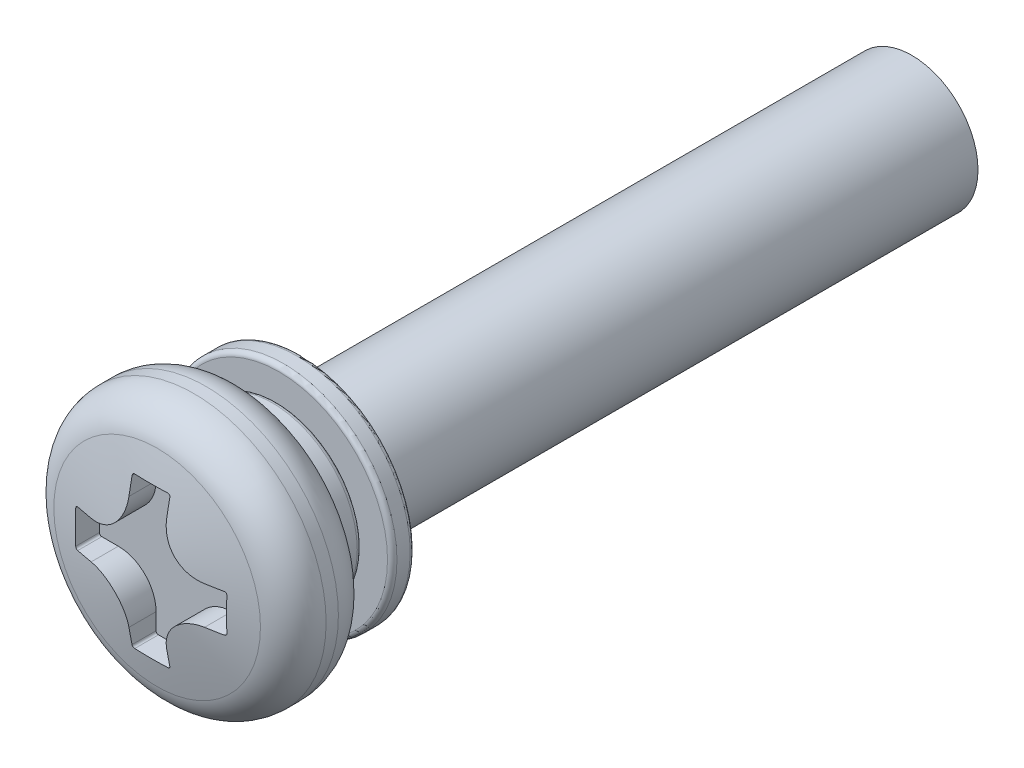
ISO-10303-21;
HEADER;
FILE_DESCRIPTION(('STEP AP214'),'2;1');
FILE_NAME('part.step','',(''),(''),'','','');
FILE_SCHEMA(('AUTOMOTIVE_DESIGN { 1 0 10303 214 1 1 1 1 }'));
ENDSEC;
DATA;
#1=APPLICATION_CONTEXT('core data for automotive mechanical design processes');
#2=APPLICATION_PROTOCOL_DEFINITION('international standard','automotive_design',2000,#1);
#3=PRODUCT_CONTEXT('',#1,'mechanical');
#4=PRODUCT('Part','Part','',(#3));
#5=PRODUCT_RELATED_PRODUCT_CATEGORY('part','',(#4));
#6=PRODUCT_DEFINITION_FORMATION('','',#4);
#7=PRODUCT_DEFINITION_CONTEXT('part definition',#1,'design');
#8=PRODUCT_DEFINITION('design','',#6,#7);
#9=PRODUCT_DEFINITION_SHAPE('','',#8);
#10=(LENGTH_UNIT() NAMED_UNIT(*) SI_UNIT(.MILLI.,.METRE.));
#11=(NAMED_UNIT(*) PLANE_ANGLE_UNIT() SI_UNIT($,.RADIAN.));
#12=(NAMED_UNIT(*) SI_UNIT($,.STERADIAN.) SOLID_ANGLE_UNIT());
#13=UNCERTAINTY_MEASURE_WITH_UNIT(LENGTH_MEASURE(1.E-05),#10,'distance_accuracy_value','');
#14=(GEOMETRIC_REPRESENTATION_CONTEXT(3) GLOBAL_UNCERTAINTY_ASSIGNED_CONTEXT((#13)) GLOBAL_UNIT_ASSIGNED_CONTEXT((#10,
#11,#12)) REPRESENTATION_CONTEXT('',''));
#15=CARTESIAN_POINT('',(0.,0.,0.));
#16=DIRECTION('',(0.,0.,1.));
#17=DIRECTION('',(1.,0.,0.));
#18=AXIS2_PLACEMENT_3D('',#15,#16,#17);
#19=CARTESIAN_POINT('',(0.,0.,12.3015418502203));
#20=DIRECTION('',(0.,0.,-1.));
#21=DIRECTION('',(1.,0.,0.));
#22=AXIS2_PLACEMENT_3D('',#19,#20,#21);
#23=PLANE('',#22);
#24=CARTESIAN_POINT('',(0.,0.,12.3015418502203));
#25=DIRECTION('',(0.,0.,1.));
#26=DIRECTION('',(1.,0.,0.));
#27=AXIS2_PLACEMENT_3D('',#24,#25,#26);
#28=CIRCLE('',#27,5.75);
#29=CARTESIAN_POINT('',(5.75,0.,12.3015418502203));
#30=VERTEX_POINT('',#29);
#31=EDGE_CURVE('E63',#30,#30,#28,.T.);
#32=ORIENTED_EDGE('',*,*,#31,.F.);
#33=EDGE_LOOP('',(#32));
#34=FACE_BOUND('',#33,.T.);
#35=CARTESIAN_POINT('',(0.,0.,12.3015418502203));
#36=DIRECTION('',(0.,0.,1.));
#37=DIRECTION('',(1.,0.,0.));
#38=AXIS2_PLACEMENT_3D('',#35,#36,#37);
#39=CIRCLE('',#38,3.75);
#40=CARTESIAN_POINT('',(3.75,0.,12.3015418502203));
#41=VERTEX_POINT('',#40);
#42=EDGE_CURVE('E68',#41,#41,#39,.T.);
#43=ORIENTED_EDGE('',*,*,#42,.T.);
#44=EDGE_LOOP('',(#43));
#45=FACE_BOUND('',#44,.T.);
#46=ADVANCED_FACE('F48',(#34,#45),#23,.T.);
#47=CARTESIAN_POINT('',(0.,0.,13.5015418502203));
#48=DIRECTION('',(0.,0.,-1.));
#49=DIRECTION('',(1.,0.,0.));
#50=AXIS2_PLACEMENT_3D('',#47,#48,#49);
#51=PLANE('',#50);
#52=CARTESIAN_POINT('',(0.,0.,13.5015418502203));
#53=DIRECTION('',(0.,0.,1.));
#54=DIRECTION('',(1.,0.,0.));
#55=AXIS2_PLACEMENT_3D('',#52,#53,#54);
#56=CIRCLE('',#55,5.75);
#57=CARTESIAN_POINT('',(5.75,0.,13.5015418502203));
#58=VERTEX_POINT('',#57);
#59=EDGE_CURVE('E11',#58,#58,#56,.F.);
#60=ORIENTED_EDGE('',*,*,#59,.F.);
#61=EDGE_LOOP('',(#60));
#62=FACE_BOUND('',#61,.T.);
#63=CARTESIAN_POINT('',(0.,0.,13.5015418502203));
#64=DIRECTION('',(0.,0.,1.));
#65=DIRECTION('',(1.,0.,0.));
#66=AXIS2_PLACEMENT_3D('',#63,#64,#65);
#67=CIRCLE('',#66,3.75);
#68=CARTESIAN_POINT('',(3.75,0.,13.5015418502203));
#69=VERTEX_POINT('',#68);
#70=EDGE_CURVE('E69',#69,#69,#67,.T.);
#71=ORIENTED_EDGE('',*,*,#70,.F.);
#72=EDGE_LOOP('',(#71));
#73=FACE_BOUND('',#72,.T.);
#74=ADVANCED_FACE('F84',(#62,#73),#51,.F.);
#75=CARTESIAN_POINT('',(0.,0.,12.3015418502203));
#76=DIRECTION('',(0.,0.,1.));
#77=DIRECTION('',(-1.,0.,0.));
#78=AXIS2_PLACEMENT_3D('',#75,#76,#77);
#79=CYLINDRICAL_SURFACE('',#78,6.);
#80=CARTESIAN_POINT('',(0.,0.,12.5515418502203));
#81=DIRECTION('',(0.,0.,1.));
#82=DIRECTION('',(1.,0.,0.));
#83=AXIS2_PLACEMENT_3D('',#80,#81,#82);
#84=CIRCLE('',#83,6.);
#85=CARTESIAN_POINT('',(6.,0.,12.5515418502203));
#86=VERTEX_POINT('',#85);
#87=EDGE_CURVE('E55',#86,#86,#84,.F.);
#88=ORIENTED_EDGE('',*,*,#87,.F.);
#89=EDGE_LOOP('',(#88));
#90=FACE_BOUND('',#89,.T.);
#91=CARTESIAN_POINT('',(0.,0.,13.2515418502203));
#92=DIRECTION('',(0.,0.,1.));
#93=DIRECTION('',(1.,0.,0.));
#94=AXIS2_PLACEMENT_3D('',#91,#92,#93);
#95=CIRCLE('',#94,6.);
#96=CARTESIAN_POINT('',(6.,0.,13.2515418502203));
#97=VERTEX_POINT('',#96);
#98=EDGE_CURVE('E59',#97,#97,#95,.T.);
#99=ORIENTED_EDGE('',*,*,#98,.F.);
#100=EDGE_LOOP('',(#99));
#101=FACE_BOUND('',#100,.T.);
#102=ADVANCED_FACE('F80',(#90,#101),#79,.T.);
#103=CARTESIAN_POINT('',(0.,0.,12.3015418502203));
#104=DIRECTION('',(0.,0.,1.));
#105=DIRECTION('',(-1.,0.,0.));
#106=AXIS2_PLACEMENT_3D('',#103,#104,#105);
#107=CYLINDRICAL_SURFACE('',#106,3.75);
#108=ORIENTED_EDGE('',*,*,#42,.F.);
#109=EDGE_LOOP('',(#108));
#110=FACE_BOUND('',#109,.T.);
#111=ORIENTED_EDGE('',*,*,#70,.T.);
#112=EDGE_LOOP('',(#111));
#113=FACE_BOUND('',#112,.T.);
#114=ADVANCED_FACE('F76',(#110,#113),#107,.F.);
#115=CARTESIAN_POINT('',(0.,0.,12.5515418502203));
#116=DIRECTION('',(0.,0.,-1.));
#117=DIRECTION('',(1.,0.,0.));
#118=AXIS2_PLACEMENT_3D('',#115,#116,#117);
#119=TOROIDAL_SURFACE('',#118,5.75,0.25);
#120=ORIENTED_EDGE('',*,*,#87,.T.);
#121=EDGE_LOOP('',(#120));
#122=FACE_BOUND('',#121,.T.);
#123=ORIENTED_EDGE('',*,*,#31,.T.);
#124=EDGE_LOOP('',(#123));
#125=FACE_BOUND('',#124,.T.);
#126=ADVANCED_FACE('F79',(#122,#125),#119,.T.);
#127=CARTESIAN_POINT('',(0.,0.,13.2515418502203));
#128=DIRECTION('',(0.,0.,-1.));
#129=DIRECTION('',(1.,0.,0.));
#130=AXIS2_PLACEMENT_3D('',#127,#128,#129);
#131=TOROIDAL_SURFACE('',#130,5.75,0.25);
#132=ORIENTED_EDGE('',*,*,#59,.T.);
#133=EDGE_LOOP('',(#132));
#134=FACE_BOUND('',#133,.T.);
#135=ORIENTED_EDGE('',*,*,#98,.T.);
#136=EDGE_LOOP('',(#135));
#137=FACE_BOUND('',#136,.T.);
#138=ADVANCED_FACE('F50',(#134,#137),#131,.T.);
#139=CLOSED_SHELL('',(#46,#74,#102,#114,#126,#138));
#140=MANIFOLD_SOLID_BREP('B2',#139);
#141=CARTESIAN_POINT('',(0.,0.,13.6015418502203));
#142=DIRECTION('',(0.,0.,1.));
#143=DIRECTION('',(-1.,0.,0.));
#144=AXIS2_PLACEMENT_3D('',#141,#142,#143);
#145=CYLINDRICAL_SURFACE('',#144,3.75);
#146=CARTESIAN_POINT('',(0.,0.,15.1015418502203));
#147=DIRECTION('',(0.,0.,-1.));
#148=DIRECTION('',(1.,0.,0.));
#149=AXIS2_PLACEMENT_3D('',#146,#147,#148);
#150=CIRCLE('',#149,3.75);
#151=CARTESIAN_POINT('',(0.599040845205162,-3.70184414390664,15.1015418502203));
#152=VERTEX_POINT('',#151);
#153=CARTESIAN_POINT('',(1.19022151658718,-3.55610358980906,15.1015418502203));
#154=VERTEX_POINT('',#153);
#155=EDGE_CURVE('E228',#152,#154,#150,.T.);
#156=ORIENTED_EDGE('',*,*,#155,.F.);
#157=DIRECTION('',(0.,0.,1.));
#158=VECTOR('',#157,1.);
#159=CARTESIAN_POINT('',(0.599040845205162,-3.70184414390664,13.6015418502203));
#160=LINE('',#159,#158);
#161=CARTESIAN_POINT('',(0.599040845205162,-3.70184414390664,13.6015418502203));
#162=VERTEX_POINT('',#161);
#163=EDGE_CURVE('E222',#162,#152,#160,.T.);
#164=ORIENTED_EDGE('',*,*,#163,.F.);
#165=CARTESIAN_POINT('',(0.,0.,13.6015418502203));
#166=DIRECTION('',(0.,0.,-1.));
#167=DIRECTION('',(1.,0.,0.));
#168=AXIS2_PLACEMENT_3D('',#165,#166,#167);
#169=CIRCLE('',#168,3.75);
#170=CARTESIAN_POINT('',(1.19022151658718,-3.55610358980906,13.6015418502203));
#171=VERTEX_POINT('',#170);
#172=EDGE_CURVE('E204',#162,#171,#169,.T.);
#173=ORIENTED_EDGE('',*,*,#172,.T.);
#174=DIRECTION('',(0.,0.,1.));
#175=VECTOR('',#174,1.);
#176=CARTESIAN_POINT('',(1.19022151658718,-3.55610358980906,13.6015418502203));
#177=LINE('',#176,#175);
#178=EDGE_CURVE('E211',#171,#154,#177,.T.);
#179=ORIENTED_EDGE('',*,*,#178,.T.);
#180=EDGE_LOOP('',(#156,#164,#173,#179));
#181=FACE_BOUND('',#180,.T.);
#182=ADVANCED_FACE('F149',(#181),#145,.F.);
#183=CARTESIAN_POINT('',(1.19022151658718,-3.55610358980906,13.6015418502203));
#184=DIRECTION('',(0.94829429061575,0.317392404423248,0.));
#185=DIRECTION('',(-0.317392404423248,0.94829429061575,0.));
#186=AXIS2_PLACEMENT_3D('',#183,#184,#185);
#187=PLANE('',#186);
#188=DIRECTION('',(0.317392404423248,-0.94829429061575,0.));
#189=VECTOR('',#188,1.);
#190=CARTESIAN_POINT('',(1.19022151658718,-3.55610358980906,15.1015418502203));
#191=LINE('',#190,#189);
#192=CARTESIAN_POINT('',(1.34891771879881,-4.03025073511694,15.1015418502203));
#193=VERTEX_POINT('',#192);
#194=EDGE_CURVE('E214',#154,#193,#191,.T.);
#195=ORIENTED_EDGE('',*,*,#194,.F.);
#196=ORIENTED_EDGE('',*,*,#178,.F.);
#197=DIRECTION('',(0.317392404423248,-0.94829429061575,0.));
#198=VECTOR('',#197,1.);
#199=CARTESIAN_POINT('',(1.19022151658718,-3.55610358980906,13.6015418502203));
#200=LINE('',#199,#198);
#201=CARTESIAN_POINT('',(1.34891771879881,-4.03025073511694,13.6015418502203));
#202=VERTEX_POINT('',#201);
#203=EDGE_CURVE('E200',#171,#202,#200,.T.);
#204=ORIENTED_EDGE('',*,*,#203,.T.);
#205=CARTESIAN_POINT('',(1.34891771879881,-4.03025073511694,13.8515418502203));
#206=DIRECTION('',(-0.94829429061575,-0.317392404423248,0.));
#207=DIRECTION('',(-0.317392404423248,0.94829429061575,0.));
#208=AXIS2_PLACEMENT_3D('',#205,#206,#207);
#209=CIRCLE('',#208,0.25);
#210=CARTESIAN_POINT('',(1.42826581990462,-4.26732430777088,13.8515418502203));
#211=VERTEX_POINT('',#210);
#212=EDGE_CURVE('E246',#211,#202,#209,.F.);
#213=ORIENTED_EDGE('',*,*,#212,.F.);
#214=DIRECTION('',(0.,0.,1.));
#215=VECTOR('',#214,1.);
#216=CARTESIAN_POINT('',(1.42826581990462,-4.26732430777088,13.6015418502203));
#217=LINE('',#216,#215);
#218=CARTESIAN_POINT('',(1.42826581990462,-4.26732430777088,14.8515418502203));
#219=VERTEX_POINT('',#218);
#220=EDGE_CURVE('E219',#211,#219,#217,.T.);
#221=ORIENTED_EDGE('',*,*,#220,.T.);
#222=CARTESIAN_POINT('',(1.34891771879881,-4.03025073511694,14.8515418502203));
#223=DIRECTION('',(-0.94829429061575,-0.317392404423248,0.));
#224=DIRECTION('',(-0.317392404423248,0.94829429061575,0.));
#225=AXIS2_PLACEMENT_3D('',#222,#223,#224);
#226=CIRCLE('',#225,0.25);
#227=EDGE_CURVE('E157',#193,#219,#226,.F.);
#228=ORIENTED_EDGE('',*,*,#227,.F.);
#229=EDGE_LOOP('',(#195,#196,#204,#213,#221,#228));
#230=FACE_BOUND('',#229,.T.);
#231=ADVANCED_FACE('F212',(#230),#187,.F.);
#232=CARTESIAN_POINT('',(0.,0.,13.6015418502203));
#233=DIRECTION('',(0.,0.,1.));
#234=DIRECTION('',(-1.,0.,0.));
#235=AXIS2_PLACEMENT_3D('',#232,#233,#234);
#236=CYLINDRICAL_SURFACE('',#235,4.5);
#237=ORIENTED_EDGE('',*,*,#220,.F.);
#238=CARTESIAN_POINT('',(0.,0.,13.8515418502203));
#239=DIRECTION('',(0.,0.,1.));
#240=DIRECTION('',(1.,0.,0.));
#241=AXIS2_PLACEMENT_3D('',#238,#239,#240);
#242=CIRCLE('',#241,4.5);
#243=CARTESIAN_POINT('',(0.718849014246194,-4.44221297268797,13.8515418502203));
#244=VERTEX_POINT('',#243);
#245=EDGE_CURVE('E218',#244,#211,#242,.F.);
#246=ORIENTED_EDGE('',*,*,#245,.F.);
#247=DIRECTION('',(0.,0.,1.));
#248=VECTOR('',#247,1.);
#249=CARTESIAN_POINT('',(0.718849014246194,-4.44221297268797,13.6015418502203));
#250=LINE('',#249,#248);
#251=CARTESIAN_POINT('',(0.718849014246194,-4.44221297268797,14.8515418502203));
#252=VERTEX_POINT('',#251);
#253=EDGE_CURVE('E232',#244,#252,#250,.T.);
#254=ORIENTED_EDGE('',*,*,#253,.T.);
#255=CARTESIAN_POINT('',(0.,0.,14.8515418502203));
#256=DIRECTION('',(0.,0.,1.));
#257=DIRECTION('',(1.,0.,0.));
#258=AXIS2_PLACEMENT_3D('',#255,#256,#257);
#259=CIRCLE('',#258,4.5);
#260=EDGE_CURVE('E238',#219,#252,#259,.T.);
#261=ORIENTED_EDGE('',*,*,#260,.F.);
#262=EDGE_LOOP('',(#237,#246,#254,#261));
#263=FACE_BOUND('',#262,.T.);
#264=ADVANCED_FACE('F251',(#263),#236,.T.);
#265=CARTESIAN_POINT('',(0.599040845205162,-3.70184414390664,13.6015418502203));
#266=DIRECTION('',(-0.987158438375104,-0.159744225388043,0.));
#267=DIRECTION('',(0.159744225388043,-0.987158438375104,0.));
#268=AXIS2_PLACEMENT_3D('',#265,#266,#267);
#269=PLANE('',#268);
#270=ORIENTED_EDGE('',*,*,#253,.F.);
#271=CARTESIAN_POINT('',(0.678912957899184,-4.19542336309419,13.8515418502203));
#272=DIRECTION('',(0.987158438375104,0.159744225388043,0.));
#273=DIRECTION('',(0.159744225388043,-0.987158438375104,0.));
#274=AXIS2_PLACEMENT_3D('',#271,#272,#273);
#275=CIRCLE('',#274,0.25);
#276=CARTESIAN_POINT('',(0.678912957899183,-4.19542336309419,13.6015418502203));
#277=VERTEX_POINT('',#276);
#278=EDGE_CURVE('E241',#277,#244,#275,.F.);
#279=ORIENTED_EDGE('',*,*,#278,.F.);
#280=DIRECTION('',(-0.159744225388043,0.987158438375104,0.));
#281=VECTOR('',#280,1.);
#282=CARTESIAN_POINT('',(0.599040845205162,-3.70184414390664,13.6015418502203));
#283=LINE('',#282,#281);
#284=EDGE_CURVE('E208',#277,#162,#283,.T.);
#285=ORIENTED_EDGE('',*,*,#284,.T.);
#286=ORIENTED_EDGE('',*,*,#163,.T.);
#287=DIRECTION('',(-0.159744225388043,0.987158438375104,0.));
#288=VECTOR('',#287,1.);
#289=CARTESIAN_POINT('',(0.599040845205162,-3.70184414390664,15.1015418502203));
#290=LINE('',#289,#288);
#291=CARTESIAN_POINT('',(0.678912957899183,-4.19542336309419,15.1015418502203));
#292=VERTEX_POINT('',#291);
#293=EDGE_CURVE('E223',#292,#152,#290,.T.);
#294=ORIENTED_EDGE('',*,*,#293,.F.);
#295=CARTESIAN_POINT('',(0.678912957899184,-4.19542336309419,14.8515418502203));
#296=DIRECTION('',(0.987158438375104,0.159744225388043,0.));
#297=DIRECTION('',(0.159744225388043,-0.987158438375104,0.));
#298=AXIS2_PLACEMENT_3D('',#295,#296,#297);
#299=CIRCLE('',#298,0.25);
#300=EDGE_CURVE('E243',#252,#292,#299,.F.);
#301=ORIENTED_EDGE('',*,*,#300,.F.);
#302=EDGE_LOOP('',(#270,#279,#285,#286,#294,#301));
#303=FACE_BOUND('',#302,.T.);
#304=ADVANCED_FACE('F255',(#303),#269,.F.);
#305=CARTESIAN_POINT('',(0.,0.,13.6015418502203));
#306=DIRECTION('',(0.,0.,-1.));
#307=DIRECTION('',(1.,0.,0.));
#308=AXIS2_PLACEMENT_3D('',#305,#306,#307);
#309=PLANE('',#308);
#310=ORIENTED_EDGE('',*,*,#203,.F.);
#311=ORIENTED_EDGE('',*,*,#172,.F.);
#312=ORIENTED_EDGE('',*,*,#284,.F.);
#313=CARTESIAN_POINT('',(0.,0.,13.6015418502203));
#314=DIRECTION('',(0.,0.,1.));
#315=DIRECTION('',(1.,0.,0.));
#316=AXIS2_PLACEMENT_3D('',#313,#314,#315);
#317=CIRCLE('',#316,4.25);
#318=EDGE_CURVE('E46',#202,#277,#317,.T.);
#319=ORIENTED_EDGE('',*,*,#318,.F.);
#320=EDGE_LOOP('',(#310,#311,#312,#319));
#321=FACE_BOUND('',#320,.T.);
#322=ADVANCED_FACE('F202',(#321),#309,.T.);
#323=CARTESIAN_POINT('',(0.,0.,15.1015418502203));
#324=DIRECTION('',(0.,0.,-1.));
#325=DIRECTION('',(1.,0.,0.));
#326=AXIS2_PLACEMENT_3D('',#323,#324,#325);
#327=PLANE('',#326);
#328=ORIENTED_EDGE('',*,*,#293,.T.);
#329=ORIENTED_EDGE('',*,*,#155,.T.);
#330=ORIENTED_EDGE('',*,*,#194,.T.);
#331=CARTESIAN_POINT('',(0.,0.,15.1015418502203));
#332=DIRECTION('',(0.,0.,1.));
#333=DIRECTION('',(1.,0.,0.));
#334=AXIS2_PLACEMENT_3D('',#331,#332,#333);
#335=CIRCLE('',#334,4.25);
#336=EDGE_CURVE('E170',#292,#193,#335,.F.);
#337=ORIENTED_EDGE('',*,*,#336,.F.);
#338=EDGE_LOOP('',(#328,#329,#330,#337));
#339=FACE_BOUND('',#338,.T.);
#340=ADVANCED_FACE('F258',(#339),#327,.F.);
#341=CARTESIAN_POINT('',(0.,0.,14.8515418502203));
#342=DIRECTION('',(0.,0.,-1.));
#343=DIRECTION('',(1.,0.,0.));
#344=AXIS2_PLACEMENT_3D('',#341,#342,#343);
#345=TOROIDAL_SURFACE('',#344,4.25,0.25);
#346=ORIENTED_EDGE('',*,*,#227,.T.);
#347=ORIENTED_EDGE('',*,*,#260,.T.);
#348=ORIENTED_EDGE('',*,*,#300,.T.);
#349=ORIENTED_EDGE('',*,*,#336,.T.);
#350=EDGE_LOOP('',(#346,#347,#348,#349));
#351=FACE_BOUND('',#350,.T.);
#352=ADVANCED_FACE('F247',(#351),#345,.T.);
#353=CARTESIAN_POINT('',(0.,0.,13.8515418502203));
#354=DIRECTION('',(0.,0.,-1.));
#355=DIRECTION('',(1.,0.,0.));
#356=AXIS2_PLACEMENT_3D('',#353,#354,#355);
#357=TOROIDAL_SURFACE('',#356,4.25,0.25);
#358=ORIENTED_EDGE('',*,*,#212,.T.);
#359=ORIENTED_EDGE('',*,*,#318,.T.);
#360=ORIENTED_EDGE('',*,*,#278,.T.);
#361=ORIENTED_EDGE('',*,*,#245,.T.);
#362=EDGE_LOOP('',(#358,#359,#360,#361));
#363=FACE_BOUND('',#362,.T.);
#364=ADVANCED_FACE('F151',(#363),#357,.T.);
#365=CLOSED_SHELL('',(#182,#231,#264,#304,#322,#340,#352,#364));
#366=MANIFOLD_SOLID_BREP('B6',#365);
#367=CARTESIAN_POINT('',(0.,3.5,-20.));
#368=DIRECTION('',(0.,0.,1.));
#369=DIRECTION('',(-1.,0.,0.));
#370=AXIS2_PLACEMENT_3D('',#367,#368,#369);
#371=PLANE('',#370);
#372=CARTESIAN_POINT('',(0.,0.,-20.));
#373=DIRECTION('',(0.,0.,1.));
#374=DIRECTION('',(1.,0.,0.));
#375=AXIS2_PLACEMENT_3D('',#372,#373,#374);
#376=CIRCLE('',#375,3.5);
#377=CARTESIAN_POINT('',(3.5,0.,-20.));
#378=VERTEX_POINT('',#377);
#379=EDGE_CURVE('E513',#378,#378,#376,.T.);
#380=ORIENTED_EDGE('',*,*,#379,.F.);
#381=EDGE_LOOP('',(#380));
#382=FACE_BOUND('',#381,.T.);
#383=ADVANCED_FACE('F325',(#382),#371,.F.);
#384=CARTESIAN_POINT('',(0.,0.,-24.8809047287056));
#385=DIRECTION('',(0.,0.,-1.));
#386=DIRECTION('',(1.,0.,0.));
#387=AXIS2_PLACEMENT_3D('',#384,#385,#386);
#388=DEGENERATE_TOROIDAL_SURFACE('',#387,5.32623718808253,46.1067247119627,.F.);
#389=CARTESIAN_POINT('',(1.,-5.18356735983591,19.9895302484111));
#390=CARTESIAN_POINT('',(1.,-4.8949769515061,20.0564759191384));
#391=CARTESIAN_POINT('',(1.,-4.60572035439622,20.1205945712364));
#392=CARTESIAN_POINT('',(1.,-4.02609682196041,20.2428671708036));
#393=CARTESIAN_POINT('',(1.,-3.73573049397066,20.3010239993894));
#394=CARTESIAN_POINT('',(1.,-3.2992901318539,20.383604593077));
#395=CARTESIAN_POINT('',(1.,-3.15365433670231,20.4103568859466));
#396=CARTESIAN_POINT('',(1.,-2.86209272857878,20.4622266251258));
#397=CARTESIAN_POINT('',(1.,-2.71616691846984,20.4873440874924));
#398=CARTESIAN_POINT('',(1.,-2.4239542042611,20.5358482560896));
#399=CARTESIAN_POINT('',(1.,-2.27766715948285,20.5592341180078));
#400=CARTESIAN_POINT('',(1.,-1.98478403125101,20.6040110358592));
#401=CARTESIAN_POINT('',(1.,-1.83818793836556,20.6254020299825));
#402=CARTESIAN_POINT('',(1.,-1.6914326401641,20.6456695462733));
#403=B_SPLINE_CURVE_WITH_KNOTS('',3,(#389,#390,#391,#392,#393,#394,#395,#396,#397,#398,#399,
#400,#401,#402),.UNSPECIFIED.,.F.,.F.,(4,2,2,2,2,2,4),(0.,0.888763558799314,1.77709556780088,
2.22130533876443,2.66551074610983,3.10993133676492,3.55436569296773),.UNSPECIFIED.);
#404=CARTESIAN_POINT('',(1.,-3.875,20.2723336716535));
#405=VERTEX_POINT('',#404);
#406=CARTESIAN_POINT('',(1.,-3.00000000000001,20.4376916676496));
#407=VERTEX_POINT('',#406);
#408=EDGE_CURVE('E337',#405,#407,#403,.T.);
#409=ORIENTED_EDGE('',*,*,#408,.F.);
#410=CARTESIAN_POINT('',(0.874799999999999,-3.9999998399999,20.2531066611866));
#411=CARTESIAN_POINT('',(0.881696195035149,-4.00001734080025,20.2527956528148));
#412=CARTESIAN_POINT('',(0.888596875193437,-3.99945158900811,20.2525996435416));
#413=CARTESIAN_POINT('',(0.902207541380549,-3.997195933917,20.2524381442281));
#414=CARTESIAN_POINT('',(0.908917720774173,-3.99550721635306,20.252472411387));
#415=CARTESIAN_POINT('',(0.921966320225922,-3.99104673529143,20.2527714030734));
#416=CARTESIAN_POINT('',(0.928304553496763,-3.98827443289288,20.2530362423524));
#417=CARTESIAN_POINT('',(0.940427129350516,-3.98173190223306,20.2537880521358));
#418=CARTESIAN_POINT('',(0.946211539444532,-3.97796179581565,20.254274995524));
#419=CARTESIAN_POINT('',(0.957085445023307,-3.9695224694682,20.2554583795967));
#420=CARTESIAN_POINT('',(0.962172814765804,-3.96485059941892,20.2561554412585));
#421=CARTESIAN_POINT('',(0.971498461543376,-3.95475147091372,20.2577383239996));
#422=CARTESIAN_POINT('',(0.97573657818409,-3.94932407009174,20.2586241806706));
#423=CARTESIAN_POINT('',(0.983311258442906,-3.93778542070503,20.2605737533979));
#424=CARTESIAN_POINT('',(0.98663365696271,-3.93166529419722,20.2616398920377));
#425=CARTESIAN_POINT('',(0.992211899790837,-3.91898117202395,20.2639108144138));
#426=CARTESIAN_POINT('',(0.994467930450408,-3.91241725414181,20.2651155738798));
#427=CARTESIAN_POINT('',(0.9974486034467,-3.90066370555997,20.2673233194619));
#428=CARTESIAN_POINT('',(0.998412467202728,-3.89552901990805,20.2683039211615));
#429=CARTESIAN_POINT('',(0.999692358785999,-3.8851954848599,20.2703091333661));
#430=CARTESIAN_POINT('',(1.00000928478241,-3.87999673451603,20.2713336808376));
#431=CARTESIAN_POINT('',(0.999999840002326,-3.87480000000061,20.2723736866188));
#432=B_SPLINE_CURVE_WITH_KNOTS('',3,(#410,#411,#412,#413,#414,#415,#416,#417,#418,#419,#420,
#421,#422,#423,#424,#425,#426,#427,#428,#429,#430,#431),.UNSPECIFIED.,.F.,.F.,(4,2,2,2,2,2,2,2,
2,2,4),(0.,0.0206822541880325,0.0413427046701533,0.0620134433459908,0.0826816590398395,
0.10341156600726,0.124145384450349,0.145183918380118,0.166218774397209,0.182127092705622,
0.198013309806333),.UNSPECIFIED.);
#433=CARTESIAN_POINT('',(0.874999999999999,-4.,20.2530977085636));
#434=VERTEX_POINT('',#433);
#435=EDGE_CURVE('E709',#434,#405,#432,.T.);
#436=ORIENTED_EDGE('',*,*,#435,.F.);
#437=CARTESIAN_POINT('',(-2.8773738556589,-4.,20.0712138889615));
#438=CARTESIAN_POINT('',(-2.66860578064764,-4.,20.0990162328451));
#439=CARTESIAN_POINT('',(-2.459494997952,-4.,20.1243607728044));
#440=CARTESIAN_POINT('',(-2.04064352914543,-4.,20.1695842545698));
#441=CARTESIAN_POINT('',(-1.83090272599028,-4.,20.1894621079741));
#442=CARTESIAN_POINT('',(-1.4109456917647,-4.,20.2231894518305));
#443=CARTESIAN_POINT('',(-1.20072949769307,-4.,20.2370393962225));
#444=CARTESIAN_POINT('',(-0.779981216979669,-4.,20.2582059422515));
#445=CARTESIAN_POINT('',(-0.569449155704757,-4.,20.265523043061));
#446=CARTESIAN_POINT('',(-0.149867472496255,-4.,20.2732791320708));
#447=CARTESIAN_POINT('',(0.0591811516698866,-4.,20.2737703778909));
#448=CARTESIAN_POINT('',(0.477182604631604,-4.,20.267992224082));
#449=CARTESIAN_POINT('',(0.686135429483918,-4.,20.2617225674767));
#450=CARTESIAN_POINT('',(1.31241966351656,-4.,20.2331560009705));
#451=CARTESIAN_POINT('',(1.72935075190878,-4.,20.2011043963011));
#452=CARTESIAN_POINT('',(2.20610809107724,-4.,20.1517579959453));
#453=CARTESIAN_POINT('',(2.26718246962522,-4.,20.1451966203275));
#454=CARTESIAN_POINT('',(2.38927790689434,-4.,20.1316153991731));
#455=CARTESIAN_POINT('',(2.45029896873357,-4.,20.1245955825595));
#456=CARTESIAN_POINT('',(2.57235937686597,-4.,20.1101015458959));
#457=CARTESIAN_POINT('',(2.6333986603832,-4.,20.102626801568));
#458=CARTESIAN_POINT('',(2.75542589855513,-4.,20.0872428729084));
#459=CARTESIAN_POINT('',(2.81641385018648,-4.,20.0793336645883));
#460=CARTESIAN_POINT('',(2.8773738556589,-4.,20.0712138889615));
#461=B_SPLINE_CURVE_WITH_KNOTS('',3,(#437,#438,#439,#440,#441,#442,#443,#444,#445,#446,#447,
#448,#449,#450,#451,#452,#453,#454,#455,#456,#457,#458,#459,#460),.UNSPECIFIED.,.F.,.F.,(4,2,2,
2,2,2,2,2,2,2,2,4),(0.,0.631841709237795,1.26380912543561,1.89572894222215,2.52760047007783,
3.15463180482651,3.7816869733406,5.03527638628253,5.21955584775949,5.40382369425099,
5.58830807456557,5.77280265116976),.UNSPECIFIED.);
#462=CARTESIAN_POINT('',(-0.874999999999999,-4.,20.2530977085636));
#463=VERTEX_POINT('',#462);
#464=EDGE_CURVE('E702',#463,#434,#461,.T.);
#465=ORIENTED_EDGE('',*,*,#464,.F.);
#466=CARTESIAN_POINT('',(-0.999999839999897,-3.8748,20.2723736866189));
#467=CARTESIAN_POINT('',(-1.00001681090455,-3.8818817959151,20.2709562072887));
#468=CARTESIAN_POINT('',(-0.999420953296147,-3.88897022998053,20.2695672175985));
#469=CARTESIAN_POINT('',(-0.997037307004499,-3.90296216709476,20.2668833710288));
#470=CARTESIAN_POINT('',(-0.995249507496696,-3.90986566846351,20.2655885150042));
#471=CARTESIAN_POINT('',(-0.99051365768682,-3.923295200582,20.2631290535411));
#472=CARTESIAN_POINT('',(-0.987564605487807,-3.92982089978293,20.2619645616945));
#473=CARTESIAN_POINT('',(-0.980583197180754,-3.94229190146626,20.2598016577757));
#474=CARTESIAN_POINT('',(-0.976551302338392,-3.94823744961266,20.2588031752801));
#475=CARTESIAN_POINT('',(-0.967572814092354,-3.95929298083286,20.2570142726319));
#476=CARTESIAN_POINT('',(-0.96263931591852,-3.96441316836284,20.2562212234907));
#477=CARTESIAN_POINT('',(-0.95195762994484,-3.97375655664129,20.2548498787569));
#478=CARTESIAN_POINT('',(-0.946209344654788,-3.97797964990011,20.254271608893));
#479=CARTESIAN_POINT('',(-0.934182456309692,-3.98532294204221,20.2533570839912));
#480=CARTESIAN_POINT('',(-0.927916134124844,-3.98846273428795,20.2530164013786));
#481=CARTESIAN_POINT('',(-0.914941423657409,-3.99365248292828,20.2525700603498));
#482=CARTESIAN_POINT('',(-0.908233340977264,-3.99570318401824,20.2524642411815));
#483=CARTESIAN_POINT('',(-0.89703348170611,-3.99812427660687,20.2524855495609));
#484=CARTESIAN_POINT('',(-0.892611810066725,-3.99883369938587,20.2525426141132));
#485=CARTESIAN_POINT('',(-0.883726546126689,-3.99977501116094,20.2527529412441));
#486=CARTESIAN_POINT('',(-0.87926302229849,-4.00000757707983,20.2529060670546));
#487=CARTESIAN_POINT('',(-0.874800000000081,-3.99999984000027,20.2531066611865));
#488=B_SPLINE_CURVE_WITH_KNOTS('',3,(#466,#467,#468,#469,#470,#471,#472,#473,#474,#475,#476,
#477,#478,#479,#480,#481,#482,#483,#484,#485,#486,#487),.UNSPECIFIED.,.F.,.F.,(4,2,2,2,2,2,2,2,
2,2,4),(0.,0.0216414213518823,0.0432830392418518,0.0649433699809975,0.0865944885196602,
0.107953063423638,0.129314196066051,0.150265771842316,0.171203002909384,0.184614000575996,
0.198005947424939),.UNSPECIFIED.);
#489=CARTESIAN_POINT('',(-1.,-3.875,20.2723336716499));
#490=VERTEX_POINT('',#489);
#491=EDGE_CURVE('E694',#490,#463,#488,.T.);
#492=ORIENTED_EDGE('',*,*,#491,.F.);
#493=CARTESIAN_POINT('',(-1.,-1.6914326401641,20.6456695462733));
#494=CARTESIAN_POINT('',(-1.,-1.77312024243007,20.634403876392));
#495=CARTESIAN_POINT('',(-1.,-1.85475702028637,20.6227756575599));
#496=CARTESIAN_POINT('',(-1.,-2.01793272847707,20.5988571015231));
#497=CARTESIAN_POINT('',(-1.,-2.09947165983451,20.5865667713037));
#498=CARTESIAN_POINT('',(-1.,-2.34394407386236,20.5487976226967));
#499=CARTESIAN_POINT('',(-1.,-2.50673908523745,20.5224198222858));
#500=CARTESIAN_POINT('',(-1.,-2.83188201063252,20.4675510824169));
#501=CARTESIAN_POINT('',(-1.,-2.99423011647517,20.4390612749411));
#502=CARTESIAN_POINT('',(-1.,-3.31856598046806,20.3800955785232));
#503=CARTESIAN_POINT('',(-1.,-3.4805537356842,20.3496196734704));
#504=CARTESIAN_POINT('',(-0.999999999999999,-3.90014229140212,20.268129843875));
#505=CARTESIAN_POINT('',(-0.999999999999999,-4.15746060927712,20.2156566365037));
#506=CARTESIAN_POINT('',(-0.999999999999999,-4.67121672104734,20.1060454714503));
#507=CARTESIAN_POINT('',(-0.999999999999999,-4.92765409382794,20.0489055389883));
#508=CARTESIAN_POINT('',(-0.999999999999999,-5.18356735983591,19.9895302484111));
#509=B_SPLINE_CURVE_WITH_KNOTS('',3,(#493,#494,#495,#496,#497,#498,#499,#500,#501,#502,#503,
#504,#505,#506,#507,#508),.UNSPECIFIED.,.F.,.F.,(4,2,2,2,2,2,2,4),(0.,0.247380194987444,
0.494757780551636,0.989495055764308,1.48396905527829,1.97844706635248,2.76624369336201,
3.55437543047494),.UNSPECIFIED.);
#510=CARTESIAN_POINT('',(-1.,-3.00000000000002,20.4376916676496));
#511=VERTEX_POINT('',#510);
#512=EDGE_CURVE('E686',#511,#490,#509,.T.);
#513=ORIENTED_EDGE('',*,*,#512,.F.);
#514=CARTESIAN_POINT('',(-3.00020000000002,-1.00000001,20.4376561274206));
#515=CARTESIAN_POINT('',(-2.94445276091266,-0.999995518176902,20.4475609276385));
#516=CARTESIAN_POINT('',(-2.88868558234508,-1.0023211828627,20.4572115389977));
#517=CARTESIAN_POINT('',(-2.77743311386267,-1.01163776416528,20.4759017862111));
#518=CARTESIAN_POINT('',(-2.72194785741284,-1.01862922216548,20.4849413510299));
#519=CARTESIAN_POINT('',(-2.55640612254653,-1.04661076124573,20.5109879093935));
#520=CARTESIAN_POINT('',(-2.44727501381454,-1.07460801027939,20.5269207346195));
#521=CARTESIAN_POINT('',(-2.23470951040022,-1.14877508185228,20.5548451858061));
#522=CARTESIAN_POINT('',(-2.13128298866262,-1.19496933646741,20.56683147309));
#523=CARTESIAN_POINT('',(-1.93342121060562,-1.30436926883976,20.5856982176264));
#524=CARTESIAN_POINT('',(-1.83897762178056,-1.36755896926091,20.5925834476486));
#525=CARTESIAN_POINT('',(-1.66494107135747,-1.5068063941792,20.6002700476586));
#526=CARTESIAN_POINT('',(-1.58495979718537,-1.58236849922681,20.601265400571));
#527=CARTESIAN_POINT('',(-1.43850302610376,-1.7455112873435,20.5975590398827));
#528=CARTESIAN_POINT('',(-1.37202942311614,-1.83309365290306,20.5928565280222));
#529=CARTESIAN_POINT('',(-1.25559050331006,-2.01584691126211,20.5784858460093));
#530=CARTESIAN_POINT('',(-1.20533317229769,-2.11084016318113,20.5689145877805));
#531=CARTESIAN_POINT('',(-1.12077217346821,-2.30723124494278,20.5457809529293));
#532=CARTESIAN_POINT('',(-1.08646847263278,-2.40862906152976,20.5322185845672));
#533=CARTESIAN_POINT('',(-1.04033712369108,-2.59190478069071,20.5054527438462));
#534=CARTESIAN_POINT('',(-1.02519322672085,-2.67305703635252,20.4928516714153));
#535=CARTESIAN_POINT('',(-1.00502029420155,-2.83623401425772,20.4662284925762));
#536=CARTESIAN_POINT('',(-0.999973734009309,-2.91825697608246,20.4522088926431));
#537=CARTESIAN_POINT('',(-1.00000001,-3.00020000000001,20.4376561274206));
#538=B_SPLINE_CURVE_WITH_KNOTS('',3,(#514,#515,#516,#517,#518,#519,#520,#521,#522,#523,#524,
#525,#526,#527,#528,#529,#530,#531,#532,#533,#534,#535,#536,#537),.UNSPECIFIED.,.F.,.F.,(4,2,2,
2,2,2,2,2,2,2,2,4),(0.,0.169761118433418,0.339541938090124,0.679137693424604,1.01919096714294,
1.35892566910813,1.68740605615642,2.01593246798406,2.33816153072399,2.66038992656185,
2.91031036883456,3.15979667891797),.UNSPECIFIED.);
#539=CARTESIAN_POINT('',(-3.00000000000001,-1.,20.4376916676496));
#540=VERTEX_POINT('',#539);
#541=EDGE_CURVE('E678',#540,#511,#538,.T.);
#542=ORIENTED_EDGE('',*,*,#541,.F.);
#543=CARTESIAN_POINT('',(-5.18356735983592,-1.,19.9895302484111));
#544=CARTESIAN_POINT('',(-4.8949769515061,-1.,20.0564759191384));
#545=CARTESIAN_POINT('',(-4.60572035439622,-1.,20.1205945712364));
#546=CARTESIAN_POINT('',(-4.02609682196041,-1.,20.2428671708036));
#547=CARTESIAN_POINT('',(-3.73573049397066,-1.,20.3010239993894));
#548=CARTESIAN_POINT('',(-3.2992901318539,-1.,20.383604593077));
#549=CARTESIAN_POINT('',(-3.15365433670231,-1.,20.4103568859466));
#550=CARTESIAN_POINT('',(-2.86209272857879,-1.,20.4622266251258));
#551=CARTESIAN_POINT('',(-2.71616691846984,-1.,20.4873440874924));
#552=CARTESIAN_POINT('',(-2.4239542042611,-1.,20.5358482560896));
#553=CARTESIAN_POINT('',(-2.27766715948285,-1.,20.5592341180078));
#554=CARTESIAN_POINT('',(-1.98478403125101,-1.,20.6040110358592));
#555=CARTESIAN_POINT('',(-1.83818793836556,-1.,20.6254020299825));
#556=CARTESIAN_POINT('',(-1.6914326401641,-1.,20.6456695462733));
#557=B_SPLINE_CURVE_WITH_KNOTS('',3,(#543,#544,#545,#546,#547,#548,#549,#550,#551,#552,#553,
#554,#555,#556),.UNSPECIFIED.,.F.,.F.,(4,2,2,2,2,2,4),(0.,0.888763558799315,1.77709556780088,
2.22130533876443,2.66551074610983,3.10993133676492,3.55436569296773),.UNSPECIFIED.);
#558=CARTESIAN_POINT('',(-3.875,-1.,20.2723336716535));
#559=VERTEX_POINT('',#558);
#560=EDGE_CURVE('E670',#559,#540,#557,.T.);
#561=ORIENTED_EDGE('',*,*,#560,.F.);
#562=CARTESIAN_POINT('',(-3.9999998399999,-0.8748,20.2531066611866));
#563=CARTESIAN_POINT('',(-4.00001734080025,-0.881696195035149,20.2527956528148));
#564=CARTESIAN_POINT('',(-3.99945158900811,-0.888596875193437,20.2525996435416));
#565=CARTESIAN_POINT('',(-3.997195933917,-0.90220754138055,20.2524381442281));
#566=CARTESIAN_POINT('',(-3.99550721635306,-0.908917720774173,20.252472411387));
#567=CARTESIAN_POINT('',(-3.99104673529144,-0.921966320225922,20.2527714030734));
#568=CARTESIAN_POINT('',(-3.98827443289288,-0.928304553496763,20.2530362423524));
#569=CARTESIAN_POINT('',(-3.98173190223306,-0.940427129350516,20.2537880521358));
#570=CARTESIAN_POINT('',(-3.97796179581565,-0.946211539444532,20.254274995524));
#571=CARTESIAN_POINT('',(-3.9695224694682,-0.957085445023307,20.2554583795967));
#572=CARTESIAN_POINT('',(-3.96485059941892,-0.962172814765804,20.2561554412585));
#573=CARTESIAN_POINT('',(-3.95475147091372,-0.971498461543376,20.2577383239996));
#574=CARTESIAN_POINT('',(-3.94932407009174,-0.975736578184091,20.2586241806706));
#575=CARTESIAN_POINT('',(-3.93778542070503,-0.983311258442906,20.2605737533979));
#576=CARTESIAN_POINT('',(-3.93166529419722,-0.98663365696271,20.2616398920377));
#577=CARTESIAN_POINT('',(-3.91898117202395,-0.992211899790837,20.2639108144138));
#578=CARTESIAN_POINT('',(-3.91241725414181,-0.994467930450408,20.2651155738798));
#579=CARTESIAN_POINT('',(-3.90066370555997,-0.9974486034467,20.2673233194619));
#580=CARTESIAN_POINT('',(-3.89552901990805,-0.998412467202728,20.2683039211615));
#581=CARTESIAN_POINT('',(-3.88519548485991,-0.999692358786,20.2703091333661));
#582=CARTESIAN_POINT('',(-3.87999673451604,-1.00000928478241,20.2713336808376));
#583=CARTESIAN_POINT('',(-3.87480000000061,-0.999999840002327,20.2723736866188));
#584=B_SPLINE_CURVE_WITH_KNOTS('',3,(#562,#563,#564,#565,#566,#567,#568,#569,#570,#571,#572,
#573,#574,#575,#576,#577,#578,#579,#580,#581,#582,#583),.UNSPECIFIED.,.F.,.F.,(4,2,2,2,2,2,2,2,
2,2,4),(0.,0.0206822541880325,0.0413427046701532,0.0620134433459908,0.0826816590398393,
0.10341156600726,0.124145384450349,0.145183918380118,0.166218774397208,0.182127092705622,
0.198013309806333),.UNSPECIFIED.);
#585=CARTESIAN_POINT('',(-4.,-0.875,20.2530977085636));
#586=VERTEX_POINT('',#585);
#587=EDGE_CURVE('E662',#586,#559,#584,.T.);
#588=ORIENTED_EDGE('',*,*,#587,.F.);
#589=CARTESIAN_POINT('',(-4.,2.8773738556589,20.0712138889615));
#590=CARTESIAN_POINT('',(-4.,2.66860578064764,20.0990162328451));
#591=CARTESIAN_POINT('',(-4.,2.459494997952,20.1243607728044));
#592=CARTESIAN_POINT('',(-4.,2.04064352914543,20.1695842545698));
#593=CARTESIAN_POINT('',(-4.,1.83090272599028,20.1894621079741));
#594=CARTESIAN_POINT('',(-4.,1.4109456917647,20.2231894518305));
#595=CARTESIAN_POINT('',(-4.,1.20072949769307,20.2370393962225));
#596=CARTESIAN_POINT('',(-4.,0.779981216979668,20.2582059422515));
#597=CARTESIAN_POINT('',(-4.,0.569449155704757,20.265523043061));
#598=CARTESIAN_POINT('',(-4.,0.149867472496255,20.2732791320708));
#599=CARTESIAN_POINT('',(-4.,-0.0591811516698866,20.2737703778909));
#600=CARTESIAN_POINT('',(-4.,-0.477182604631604,20.267992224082));
#601=CARTESIAN_POINT('',(-4.,-0.686135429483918,20.2617225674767));
#602=CARTESIAN_POINT('',(-4.,-1.31241966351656,20.2331560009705));
#603=CARTESIAN_POINT('',(-4.,-1.72935075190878,20.2011043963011));
#604=CARTESIAN_POINT('',(-4.,-2.20610809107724,20.1517579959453));
#605=CARTESIAN_POINT('',(-4.,-2.26718246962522,20.1451966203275));
#606=CARTESIAN_POINT('',(-4.,-2.38927790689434,20.1316153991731));
#607=CARTESIAN_POINT('',(-4.,-2.45029896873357,20.1245955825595));
#608=CARTESIAN_POINT('',(-4.,-2.57235937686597,20.1101015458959));
#609=CARTESIAN_POINT('',(-4.,-2.6333986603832,20.102626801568));
#610=CARTESIAN_POINT('',(-4.,-2.75542589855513,20.0872428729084));
#611=CARTESIAN_POINT('',(-4.,-2.81641385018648,20.0793336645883));
#612=CARTESIAN_POINT('',(-4.,-2.8773738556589,20.0712138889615));
#613=B_SPLINE_CURVE_WITH_KNOTS('',3,(#589,#590,#591,#592,#593,#594,#595,#596,#597,#598,#599,
#600,#601,#602,#603,#604,#605,#606,#607,#608,#609,#610,#611,#612),.UNSPECIFIED.,.F.,.F.,(4,2,2,
2,2,2,2,2,2,2,2,4),(0.,0.631841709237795,1.26380912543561,1.89572894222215,2.52760047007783,
3.15463180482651,3.7816869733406,5.03527638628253,5.21955584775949,5.40382369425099,
5.58830807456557,5.77280265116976),.UNSPECIFIED.);
#614=CARTESIAN_POINT('',(-4.,0.874999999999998,20.2530977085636));
#615=VERTEX_POINT('',#614);
#616=EDGE_CURVE('E654',#615,#586,#613,.T.);
#617=ORIENTED_EDGE('',*,*,#616,.F.);
#618=CARTESIAN_POINT('',(-3.8748,0.999999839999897,20.2723736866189));
#619=CARTESIAN_POINT('',(-3.8818817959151,1.00001681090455,20.2709562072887));
#620=CARTESIAN_POINT('',(-3.88897022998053,0.999420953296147,20.2695672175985));
#621=CARTESIAN_POINT('',(-3.90296216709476,0.997037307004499,20.2668833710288));
#622=CARTESIAN_POINT('',(-3.90986566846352,0.995249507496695,20.2655885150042));
#623=CARTESIAN_POINT('',(-3.923295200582,0.990513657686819,20.2631290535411));
#624=CARTESIAN_POINT('',(-3.92982089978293,0.987564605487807,20.2619645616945));
#625=CARTESIAN_POINT('',(-3.94229190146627,0.980583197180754,20.2598016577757));
#626=CARTESIAN_POINT('',(-3.94823744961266,0.976551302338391,20.2588031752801));
#627=CARTESIAN_POINT('',(-3.95929298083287,0.967572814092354,20.2570142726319));
#628=CARTESIAN_POINT('',(-3.96441316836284,0.96263931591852,20.2562212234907));
#629=CARTESIAN_POINT('',(-3.97375655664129,0.95195762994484,20.2548498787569));
#630=CARTESIAN_POINT('',(-3.97797964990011,0.946209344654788,20.254271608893));
#631=CARTESIAN_POINT('',(-3.98532294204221,0.934182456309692,20.2533570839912));
#632=CARTESIAN_POINT('',(-3.98846273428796,0.927916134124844,20.2530164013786));
#633=CARTESIAN_POINT('',(-3.99365248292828,0.914941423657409,20.2525700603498));
#634=CARTESIAN_POINT('',(-3.99570318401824,0.908233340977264,20.2524642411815));
#635=CARTESIAN_POINT('',(-3.99812427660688,0.897033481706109,20.2524855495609));
#636=CARTESIAN_POINT('',(-3.99883369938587,0.892611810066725,20.2525426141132));
#637=CARTESIAN_POINT('',(-3.99977501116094,0.88372654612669,20.2527529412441));
#638=CARTESIAN_POINT('',(-4.00000757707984,0.87926302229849,20.2529060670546));
#639=CARTESIAN_POINT('',(-3.99999984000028,0.87480000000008,20.2531066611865));
#640=B_SPLINE_CURVE_WITH_KNOTS('',3,(#618,#619,#620,#621,#622,#623,#624,#625,#626,#627,#628,
#629,#630,#631,#632,#633,#634,#635,#636,#637,#638,#639),.UNSPECIFIED.,.F.,.F.,(4,2,2,2,2,2,2,2,
2,2,4),(0.,0.0216414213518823,0.0432830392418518,0.0649433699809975,0.0865944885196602,
0.107953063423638,0.129314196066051,0.150265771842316,0.171203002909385,0.184614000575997,
0.19800594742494),.UNSPECIFIED.);
#641=CARTESIAN_POINT('',(-3.875,0.999999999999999,20.2723336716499));
#642=VERTEX_POINT('',#641);
#643=EDGE_CURVE('E646',#642,#615,#640,.T.);
#644=ORIENTED_EDGE('',*,*,#643,.F.);
#645=CARTESIAN_POINT('',(-1.6914326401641,1.,20.6456695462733));
#646=CARTESIAN_POINT('',(-1.77312024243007,1.,20.634403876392));
#647=CARTESIAN_POINT('',(-1.85475702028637,1.,20.6227756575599));
#648=CARTESIAN_POINT('',(-2.01793272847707,1.,20.5988571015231));
#649=CARTESIAN_POINT('',(-2.09947165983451,1.,20.5865667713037));
#650=CARTESIAN_POINT('',(-2.34394407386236,1.,20.5487976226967));
#651=CARTESIAN_POINT('',(-2.50673908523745,1.,20.5224198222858));
#652=CARTESIAN_POINT('',(-2.83188201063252,1.,20.4675510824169));
#653=CARTESIAN_POINT('',(-2.99423011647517,1.,20.4390612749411));
#654=CARTESIAN_POINT('',(-3.31856598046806,1.,20.3800955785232));
#655=CARTESIAN_POINT('',(-3.4805537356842,0.999999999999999,20.3496196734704));
#656=CARTESIAN_POINT('',(-3.90014229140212,0.999999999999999,20.268129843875));
#657=CARTESIAN_POINT('',(-4.15746060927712,0.999999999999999,20.2156566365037));
#658=CARTESIAN_POINT('',(-4.67121672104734,0.999999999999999,20.1060454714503));
#659=CARTESIAN_POINT('',(-4.92765409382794,0.999999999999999,20.0489055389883));
#660=CARTESIAN_POINT('',(-5.18356735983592,0.999999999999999,19.9895302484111));
#661=B_SPLINE_CURVE_WITH_KNOTS('',3,(#645,#646,#647,#648,#649,#650,#651,#652,#653,#654,#655,
#656,#657,#658,#659,#660),.UNSPECIFIED.,.F.,.F.,(4,2,2,2,2,2,2,4),(0.,0.247380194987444,
0.494757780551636,0.989495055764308,1.48396905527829,1.97844706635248,2.76624369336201,
3.55437543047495),.UNSPECIFIED.);
#662=CARTESIAN_POINT('',(-3.00000000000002,1.,20.4376916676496));
#663=VERTEX_POINT('',#662);
#664=EDGE_CURVE('E638',#663,#642,#661,.T.);
#665=ORIENTED_EDGE('',*,*,#664,.F.);
#666=CARTESIAN_POINT('',(-1.00000001,3.00020000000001,20.4376561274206));
#667=CARTESIAN_POINT('',(-0.999995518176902,2.94445276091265,20.4475609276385));
#668=CARTESIAN_POINT('',(-1.0023211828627,2.88868558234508,20.4572115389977));
#669=CARTESIAN_POINT('',(-1.01163776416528,2.77743311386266,20.4759017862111));
#670=CARTESIAN_POINT('',(-1.01862922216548,2.72194785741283,20.4849413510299));
#671=CARTESIAN_POINT('',(-1.04661076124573,2.55640612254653,20.5109879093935));
#672=CARTESIAN_POINT('',(-1.07460801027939,2.44727501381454,20.5269207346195));
#673=CARTESIAN_POINT('',(-1.14877508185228,2.23470951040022,20.5548451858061));
#674=CARTESIAN_POINT('',(-1.19496933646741,2.13128298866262,20.56683147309));
#675=CARTESIAN_POINT('',(-1.30436926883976,1.93342121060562,20.5856982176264));
#676=CARTESIAN_POINT('',(-1.36755896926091,1.83897762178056,20.5925834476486));
#677=CARTESIAN_POINT('',(-1.5068063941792,1.66494107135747,20.6002700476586));
#678=CARTESIAN_POINT('',(-1.58236849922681,1.58495979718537,20.601265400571));
#679=CARTESIAN_POINT('',(-1.7455112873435,1.43850302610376,20.5975590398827));
#680=CARTESIAN_POINT('',(-1.83309365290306,1.37202942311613,20.5928565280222));
#681=CARTESIAN_POINT('',(-2.01584691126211,1.25559050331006,20.5784858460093));
#682=CARTESIAN_POINT('',(-2.11084016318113,1.20533317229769,20.5689145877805));
#683=CARTESIAN_POINT('',(-2.30723124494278,1.12077217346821,20.5457809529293));
#684=CARTESIAN_POINT('',(-2.40862906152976,1.08646847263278,20.5322185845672));
#685=CARTESIAN_POINT('',(-2.59190478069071,1.04033712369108,20.5054527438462));
#686=CARTESIAN_POINT('',(-2.67305703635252,1.02519322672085,20.4928516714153));
#687=CARTESIAN_POINT('',(-2.83623401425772,1.00502029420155,20.4662284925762));
#688=CARTESIAN_POINT('',(-2.91825697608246,0.999973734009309,20.4522088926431));
#689=CARTESIAN_POINT('',(-3.00020000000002,1.00000001,20.4376561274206));
#690=B_SPLINE_CURVE_WITH_KNOTS('',3,(#666,#667,#668,#669,#670,#671,#672,#673,#674,#675,#676,
#677,#678,#679,#680,#681,#682,#683,#684,#685,#686,#687,#688,#689),.UNSPECIFIED.,.F.,.F.,(4,2,2,
2,2,2,2,2,2,2,2,4),(0.,0.169761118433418,0.339541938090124,0.679137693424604,1.01919096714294,
1.35892566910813,1.68740605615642,2.01593246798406,2.33816153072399,2.66038992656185,
2.91031036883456,3.15979667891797),.UNSPECIFIED.);
#691=CARTESIAN_POINT('',(-1.,3.00000000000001,20.4376916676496));
#692=VERTEX_POINT('',#691);
#693=EDGE_CURVE('E630',#692,#663,#690,.T.);
#694=ORIENTED_EDGE('',*,*,#693,.F.);
#695=CARTESIAN_POINT('',(-1.,5.18356735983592,19.9895302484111));
#696=CARTESIAN_POINT('',(-1.,4.8949769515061,20.0564759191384));
#697=CARTESIAN_POINT('',(-1.,4.60572035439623,20.1205945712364));
#698=CARTESIAN_POINT('',(-1.,4.02609682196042,20.2428671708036));
#699=CARTESIAN_POINT('',(-1.,3.73573049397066,20.3010239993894));
#700=CARTESIAN_POINT('',(-1.,3.2992901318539,20.383604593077));
#701=CARTESIAN_POINT('',(-1.,3.15365433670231,20.4103568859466));
#702=CARTESIAN_POINT('',(-1.,2.86209272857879,20.4622266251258));
#703=CARTESIAN_POINT('',(-1.,2.71616691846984,20.4873440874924));
#704=CARTESIAN_POINT('',(-1.,2.4239542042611,20.5358482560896));
#705=CARTESIAN_POINT('',(-1.,2.27766715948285,20.5592341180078));
#706=CARTESIAN_POINT('',(-1.,1.98478403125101,20.6040110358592));
#707=CARTESIAN_POINT('',(-1.,1.83818793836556,20.6254020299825));
#708=CARTESIAN_POINT('',(-1.,1.6914326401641,20.6456695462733));
#709=B_SPLINE_CURVE_WITH_KNOTS('',3,(#695,#696,#697,#698,#699,#700,#701,#702,#703,#704,#705,
#706,#707,#708),.UNSPECIFIED.,.F.,.F.,(4,2,2,2,2,2,4),(0.,0.888763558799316,1.77709556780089,
2.22130533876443,2.66551074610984,3.10993133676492,3.55436569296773),.UNSPECIFIED.);
#710=CARTESIAN_POINT('',(-1.,3.875,20.2723336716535));
#711=VERTEX_POINT('',#710);
#712=EDGE_CURVE('E622',#711,#692,#709,.T.);
#713=ORIENTED_EDGE('',*,*,#712,.F.);
#714=CARTESIAN_POINT('',(-0.8748,3.9999998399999,20.2531066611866));
#715=CARTESIAN_POINT('',(-0.881696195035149,4.00001734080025,20.2527956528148));
#716=CARTESIAN_POINT('',(-0.888596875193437,3.99945158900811,20.2525996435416));
#717=CARTESIAN_POINT('',(-0.90220754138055,3.997195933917,20.2524381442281));
#718=CARTESIAN_POINT('',(-0.908917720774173,3.99550721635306,20.252472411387));
#719=CARTESIAN_POINT('',(-0.921966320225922,3.99104673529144,20.2527714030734));
#720=CARTESIAN_POINT('',(-0.928304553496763,3.98827443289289,20.2530362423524));
#721=CARTESIAN_POINT('',(-0.940427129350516,3.98173190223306,20.2537880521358));
#722=CARTESIAN_POINT('',(-0.946211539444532,3.97796179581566,20.254274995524));
#723=CARTESIAN_POINT('',(-0.957085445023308,3.96952246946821,20.2554583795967));
#724=CARTESIAN_POINT('',(-0.962172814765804,3.96485059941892,20.2561554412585));
#725=CARTESIAN_POINT('',(-0.971498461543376,3.95475147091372,20.2577383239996));
#726=CARTESIAN_POINT('',(-0.975736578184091,3.94932407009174,20.2586241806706));
#727=CARTESIAN_POINT('',(-0.983311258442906,3.93778542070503,20.2605737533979));
#728=CARTESIAN_POINT('',(-0.986633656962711,3.93166529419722,20.2616398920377));
#729=CARTESIAN_POINT('',(-0.992211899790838,3.91898117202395,20.2639108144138));
#730=CARTESIAN_POINT('',(-0.994467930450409,3.91241725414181,20.2651155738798));
#731=CARTESIAN_POINT('',(-0.9974486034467,3.90066370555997,20.2673233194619));
#732=CARTESIAN_POINT('',(-0.998412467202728,3.89552901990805,20.2683039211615));
#733=CARTESIAN_POINT('',(-0.999692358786,3.88519548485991,20.2703091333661));
#734=CARTESIAN_POINT('',(-1.00000928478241,3.87999673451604,20.2713336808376));
#735=CARTESIAN_POINT('',(-0.999999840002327,3.87480000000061,20.2723736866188));
#736=B_SPLINE_CURVE_WITH_KNOTS('',3,(#714,#715,#716,#717,#718,#719,#720,#721,#722,#723,#724,
#725,#726,#727,#728,#729,#730,#731,#732,#733,#734,#735),.UNSPECIFIED.,.F.,.F.,(4,2,2,2,2,2,2,2,
2,2,4),(0.,0.0206822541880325,0.0413427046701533,0.0620134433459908,0.0826816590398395,
0.10341156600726,0.124145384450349,0.145183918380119,0.166218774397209,0.182127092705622,
0.198013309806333),.UNSPECIFIED.);
#737=CARTESIAN_POINT('',(-0.875,4.,20.2530977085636));
#738=VERTEX_POINT('',#737);
#739=EDGE_CURVE('E614',#738,#711,#736,.T.);
#740=ORIENTED_EDGE('',*,*,#739,.F.);
#741=CARTESIAN_POINT('',(2.8773738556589,4.,20.0712138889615));
#742=CARTESIAN_POINT('',(2.66860578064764,4.,20.0990162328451));
#743=CARTESIAN_POINT('',(2.459494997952,4.,20.1243607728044));
#744=CARTESIAN_POINT('',(2.04064352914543,4.,20.1695842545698));
#745=CARTESIAN_POINT('',(1.83090272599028,4.,20.1894621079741));
#746=CARTESIAN_POINT('',(1.41094569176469,4.,20.2231894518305));
#747=CARTESIAN_POINT('',(1.20072949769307,4.,20.2370393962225));
#748=CARTESIAN_POINT('',(0.779981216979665,4.,20.2582059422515));
#749=CARTESIAN_POINT('',(0.569449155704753,4.,20.265523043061));
#750=CARTESIAN_POINT('',(0.14986747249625,4.,20.2732791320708));
#751=CARTESIAN_POINT('',(-0.059181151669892,4.,20.2737703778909));
#752=CARTESIAN_POINT('',(-0.47718260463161,4.,20.267992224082));
#753=CARTESIAN_POINT('',(-0.686135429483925,4.,20.2617225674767));
#754=CARTESIAN_POINT('',(-1.31241966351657,4.,20.2331560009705));
#755=CARTESIAN_POINT('',(-1.72935075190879,4.,20.2011043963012));
#756=CARTESIAN_POINT('',(-2.20610809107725,4.,20.1517579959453));
#757=CARTESIAN_POINT('',(-2.26718246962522,4.,20.1451966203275));
#758=CARTESIAN_POINT('',(-2.38927790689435,4.,20.1316153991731));
#759=CARTESIAN_POINT('',(-2.45029896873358,4.,20.1245955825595));
#760=CARTESIAN_POINT('',(-2.57235937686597,4.,20.1101015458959));
#761=CARTESIAN_POINT('',(-2.6333986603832,4.,20.102626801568));
#762=CARTESIAN_POINT('',(-2.75542589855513,4.,20.0872428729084));
#763=CARTESIAN_POINT('',(-2.81641385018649,4.,20.0793336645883));
#764=CARTESIAN_POINT('',(-2.8773738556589,4.,20.0712138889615));
#765=B_SPLINE_CURVE_WITH_KNOTS('',3,(#741,#742,#743,#744,#745,#746,#747,#748,#749,#750,#751,
#752,#753,#754,#755,#756,#757,#758,#759,#760,#761,#762,#763,#764),.UNSPECIFIED.,.F.,.F.,(4,2,2,
2,2,2,2,2,2,2,2,4),(0.,0.631841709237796,1.26380912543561,1.89572894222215,2.52760047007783,
3.15463180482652,3.78168697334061,5.03527638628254,5.21955584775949,5.40382369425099,
5.58830807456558,5.77280265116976),.UNSPECIFIED.);
#766=CARTESIAN_POINT('',(0.874999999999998,4.,20.2530977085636));
#767=VERTEX_POINT('',#766);
#768=EDGE_CURVE('E606',#767,#738,#765,.T.);
#769=ORIENTED_EDGE('',*,*,#768,.F.);
#770=CARTESIAN_POINT('',(0.999999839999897,3.8748,20.2723736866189));
#771=CARTESIAN_POINT('',(1.00001681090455,3.8818817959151,20.2709562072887));
#772=CARTESIAN_POINT('',(0.999420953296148,3.88897022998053,20.2695672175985));
#773=CARTESIAN_POINT('',(0.997037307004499,3.90296216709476,20.2668833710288));
#774=CARTESIAN_POINT('',(0.995249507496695,3.90986566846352,20.2655885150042));
#775=CARTESIAN_POINT('',(0.990513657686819,3.923295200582,20.2631290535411));
#776=CARTESIAN_POINT('',(0.987564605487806,3.92982089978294,20.2619645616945));
#777=CARTESIAN_POINT('',(0.980583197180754,3.94229190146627,20.2598016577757));
#778=CARTESIAN_POINT('',(0.976551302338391,3.94823744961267,20.2588031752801));
#779=CARTESIAN_POINT('',(0.967572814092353,3.95929298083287,20.2570142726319));
#780=CARTESIAN_POINT('',(0.962639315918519,3.96441316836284,20.2562212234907));
#781=CARTESIAN_POINT('',(0.951957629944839,3.97375655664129,20.2548498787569));
#782=CARTESIAN_POINT('',(0.946209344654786,3.97797964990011,20.254271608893));
#783=CARTESIAN_POINT('',(0.93418245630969,3.98532294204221,20.2533570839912));
#784=CARTESIAN_POINT('',(0.927916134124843,3.98846273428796,20.2530164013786));
#785=CARTESIAN_POINT('',(0.914941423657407,3.99365248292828,20.2525700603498));
#786=CARTESIAN_POINT('',(0.908233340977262,3.99570318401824,20.2524642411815));
#787=CARTESIAN_POINT('',(0.897033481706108,3.99812427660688,20.2524855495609));
#788=CARTESIAN_POINT('',(0.892611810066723,3.99883369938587,20.2525426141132));
#789=CARTESIAN_POINT('',(0.883726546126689,3.99977501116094,20.2527529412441));
#790=CARTESIAN_POINT('',(0.87926302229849,4.00000757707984,20.2529060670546));
#791=CARTESIAN_POINT('',(0.87480000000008,3.99999984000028,20.2531066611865));
#792=B_SPLINE_CURVE_WITH_KNOTS('',3,(#770,#771,#772,#773,#774,#775,#776,#777,#778,#779,#780,
#781,#782,#783,#784,#785,#786,#787,#788,#789,#790,#791),.UNSPECIFIED.,.F.,.F.,(4,2,2,2,2,2,2,2,
2,2,4),(0.,0.0216414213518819,0.0432830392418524,0.0649433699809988,0.0865944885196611,
0.10795306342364,0.129314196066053,0.150265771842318,0.171203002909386,0.184614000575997,
0.19800594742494),.UNSPECIFIED.);
#793=CARTESIAN_POINT('',(0.999999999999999,3.875,20.2723336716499));
#794=VERTEX_POINT('',#793);
#795=EDGE_CURVE('E598',#794,#767,#792,.T.);
#796=ORIENTED_EDGE('',*,*,#795,.F.);
#797=CARTESIAN_POINT('',(0.999999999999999,1.6914326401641,20.6456695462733));
#798=CARTESIAN_POINT('',(0.999999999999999,1.77312024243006,20.634403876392));
#799=CARTESIAN_POINT('',(0.999999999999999,1.85475702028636,20.6227756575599));
#800=CARTESIAN_POINT('',(0.999999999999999,2.01793272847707,20.5988571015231));
#801=CARTESIAN_POINT('',(0.999999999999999,2.0994716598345,20.5865667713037));
#802=CARTESIAN_POINT('',(0.999999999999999,2.34394407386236,20.5487976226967));
#803=CARTESIAN_POINT('',(0.999999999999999,2.50673908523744,20.5224198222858));
#804=CARTESIAN_POINT('',(0.999999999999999,2.83188201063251,20.4675510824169));
#805=CARTESIAN_POINT('',(0.999999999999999,2.99423011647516,20.4390612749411));
#806=CARTESIAN_POINT('',(0.999999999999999,3.31856598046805,20.3800955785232));
#807=CARTESIAN_POINT('',(0.999999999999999,3.48055373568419,20.3496196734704));
#808=CARTESIAN_POINT('',(0.999999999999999,3.90014229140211,20.268129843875));
#809=CARTESIAN_POINT('',(0.999999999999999,4.15746060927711,20.2156566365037));
#810=CARTESIAN_POINT('',(0.999999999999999,4.67121672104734,20.1060454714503));
#811=CARTESIAN_POINT('',(0.999999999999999,4.92765409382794,20.0489055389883));
#812=CARTESIAN_POINT('',(0.999999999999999,5.18356735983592,19.9895302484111));
#813=B_SPLINE_CURVE_WITH_KNOTS('',3,(#797,#798,#799,#800,#801,#802,#803,#804,#805,#806,#807,
#808,#809,#810,#811,#812),.UNSPECIFIED.,.F.,.F.,(4,2,2,2,2,2,2,4),(0.,0.247380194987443,
0.494757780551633,0.989495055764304,1.48396905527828,1.97844706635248,2.76624369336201,
3.55437543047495),.UNSPECIFIED.);
#814=CARTESIAN_POINT('',(0.999999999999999,3.00000000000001,20.4376916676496));
#815=VERTEX_POINT('',#814);
#816=EDGE_CURVE('E590',#815,#794,#813,.T.);
#817=ORIENTED_EDGE('',*,*,#816,.F.);
#818=CARTESIAN_POINT('',(3.00020000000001,1.00000001,20.4376561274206));
#819=CARTESIAN_POINT('',(2.94445276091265,0.999995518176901,20.4475609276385));
#820=CARTESIAN_POINT('',(2.88868558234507,1.0023211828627,20.4572115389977));
#821=CARTESIAN_POINT('',(2.77743311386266,1.01163776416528,20.4759017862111));
#822=CARTESIAN_POINT('',(2.72194785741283,1.01862922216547,20.4849413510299));
#823=CARTESIAN_POINT('',(2.55640612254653,1.04661076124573,20.5109879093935));
#824=CARTESIAN_POINT('',(2.44727501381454,1.07460801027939,20.5269207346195));
#825=CARTESIAN_POINT('',(2.23470951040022,1.14877508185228,20.5548451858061));
#826=CARTESIAN_POINT('',(2.13128298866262,1.1949693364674,20.56683147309));
#827=CARTESIAN_POINT('',(1.93342121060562,1.30436926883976,20.5856982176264));
#828=CARTESIAN_POINT('',(1.83897762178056,1.36755896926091,20.5925834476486));
#829=CARTESIAN_POINT('',(1.66494107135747,1.5068063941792,20.6002700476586));
#830=CARTESIAN_POINT('',(1.58495979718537,1.58236849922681,20.601265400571));
#831=CARTESIAN_POINT('',(1.43850302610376,1.7455112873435,20.5975590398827));
#832=CARTESIAN_POINT('',(1.37202942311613,1.83309365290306,20.5928565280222));
#833=CARTESIAN_POINT('',(1.25559050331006,2.01584691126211,20.5784858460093));
#834=CARTESIAN_POINT('',(1.20533317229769,2.11084016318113,20.5689145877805));
#835=CARTESIAN_POINT('',(1.12077217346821,2.30723124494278,20.5457809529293));
#836=CARTESIAN_POINT('',(1.08646847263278,2.40862906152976,20.5322185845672));
#837=CARTESIAN_POINT('',(1.04033712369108,2.59190478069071,20.5054527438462));
#838=CARTESIAN_POINT('',(1.02519322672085,2.67305703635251,20.4928516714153));
#839=CARTESIAN_POINT('',(1.00502029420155,2.83623401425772,20.4662284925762));
#840=CARTESIAN_POINT('',(0.999973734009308,2.91825697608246,20.4522088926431));
#841=CARTESIAN_POINT('',(1.00000001,3.00020000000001,20.4376561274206));
#842=B_SPLINE_CURVE_WITH_KNOTS('',3,(#818,#819,#820,#821,#822,#823,#824,#825,#826,#827,#828,
#829,#830,#831,#832,#833,#834,#835,#836,#837,#838,#839,#840,#841),.UNSPECIFIED.,.F.,.F.,(4,2,2,
2,2,2,2,2,2,2,2,4),(0.,0.169761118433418,0.339541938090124,0.679137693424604,1.01919096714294,
1.35892566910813,1.68740605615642,2.01593246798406,2.33816153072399,2.66038992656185,
2.91031036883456,3.15979667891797),.UNSPECIFIED.);
#843=CARTESIAN_POINT('',(3.00000000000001,1.,20.4376916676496));
#844=VERTEX_POINT('',#843);
#845=EDGE_CURVE('E582',#844,#815,#842,.T.);
#846=ORIENTED_EDGE('',*,*,#845,.F.);
#847=CARTESIAN_POINT('',(5.18356735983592,1.,19.9895302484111));
#848=CARTESIAN_POINT('',(4.8949769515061,1.,20.0564759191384));
#849=CARTESIAN_POINT('',(4.60572035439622,1.,20.1205945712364));
#850=CARTESIAN_POINT('',(4.02609682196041,1.,20.2428671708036));
#851=CARTESIAN_POINT('',(3.73573049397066,1.,20.3010239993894));
#852=CARTESIAN_POINT('',(3.2992901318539,1.,20.383604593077));
#853=CARTESIAN_POINT('',(3.15365433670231,1.,20.4103568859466));
#854=CARTESIAN_POINT('',(2.86209272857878,1.,20.4622266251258));
#855=CARTESIAN_POINT('',(2.71616691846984,1.,20.4873440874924));
#856=CARTESIAN_POINT('',(2.4239542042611,1.,20.5358482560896));
#857=CARTESIAN_POINT('',(2.27766715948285,1.,20.5592341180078));
#858=CARTESIAN_POINT('',(1.98478403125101,1.,20.6040110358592));
#859=CARTESIAN_POINT('',(1.83818793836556,1.,20.6254020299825));
#860=CARTESIAN_POINT('',(1.6914326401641,1.,20.6456695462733));
#861=B_SPLINE_CURVE_WITH_KNOTS('',3,(#847,#848,#849,#850,#851,#852,#853,#854,#855,#856,#857,
#858,#859,#860),.UNSPECIFIED.,.F.,.F.,(4,2,2,2,2,2,4),(0.,0.888763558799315,1.77709556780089,
2.22130533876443,2.66551074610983,3.10993133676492,3.55436569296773),.UNSPECIFIED.);
#862=CARTESIAN_POINT('',(3.875,1.,20.2723336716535));
#863=VERTEX_POINT('',#862);
#864=EDGE_CURVE('E574',#863,#844,#861,.T.);
#865=ORIENTED_EDGE('',*,*,#864,.F.);
#866=CARTESIAN_POINT('',(3.9999998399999,0.8748,20.2531066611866));
#867=CARTESIAN_POINT('',(4.00001734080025,0.881696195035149,20.2527956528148));
#868=CARTESIAN_POINT('',(3.99945158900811,0.888596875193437,20.2525996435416));
#869=CARTESIAN_POINT('',(3.997195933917,0.902207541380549,20.2524381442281));
#870=CARTESIAN_POINT('',(3.99550721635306,0.908917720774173,20.252472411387));
#871=CARTESIAN_POINT('',(3.99104673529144,0.921966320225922,20.2527714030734));
#872=CARTESIAN_POINT('',(3.98827443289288,0.928304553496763,20.2530362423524));
#873=CARTESIAN_POINT('',(3.98173190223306,0.940427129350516,20.2537880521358));
#874=CARTESIAN_POINT('',(3.97796179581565,0.946211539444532,20.254274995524));
#875=CARTESIAN_POINT('',(3.9695224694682,0.957085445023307,20.2554583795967));
#876=CARTESIAN_POINT('',(3.96485059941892,0.962172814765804,20.2561554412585));
#877=CARTESIAN_POINT('',(3.95475147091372,0.971498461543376,20.2577383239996));
#878=CARTESIAN_POINT('',(3.94932407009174,0.97573657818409,20.2586241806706));
#879=CARTESIAN_POINT('',(3.93778542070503,0.983311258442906,20.2605737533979));
#880=CARTESIAN_POINT('',(3.93166529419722,0.98663365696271,20.2616398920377));
#881=CARTESIAN_POINT('',(3.91898117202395,0.992211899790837,20.2639108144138));
#882=CARTESIAN_POINT('',(3.91241725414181,0.994467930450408,20.2651155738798));
#883=CARTESIAN_POINT('',(3.90066370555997,0.9974486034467,20.2673233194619));
#884=CARTESIAN_POINT('',(3.89552901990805,0.998412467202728,20.2683039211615));
#885=CARTESIAN_POINT('',(3.88519548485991,0.999692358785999,20.2703091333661));
#886=CARTESIAN_POINT('',(3.87999673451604,1.00000928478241,20.2713336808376));
#887=CARTESIAN_POINT('',(3.87480000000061,0.999999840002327,20.2723736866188));
#888=B_SPLINE_CURVE_WITH_KNOTS('',3,(#866,#867,#868,#869,#870,#871,#872,#873,#874,#875,#876,
#877,#878,#879,#880,#881,#882,#883,#884,#885,#886,#887),.UNSPECIFIED.,.F.,.F.,(4,2,2,2,2,2,2,2,
2,2,4),(0.,0.0206822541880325,0.0413427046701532,0.0620134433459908,0.0826816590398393,
0.10341156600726,0.124145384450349,0.145183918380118,0.166218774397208,0.182127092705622,
0.198013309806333),.UNSPECIFIED.);
#889=CARTESIAN_POINT('',(4.,0.874999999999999,20.2530977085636));
#890=VERTEX_POINT('',#889);
#891=EDGE_CURVE('E566',#890,#863,#888,.T.);
#892=ORIENTED_EDGE('',*,*,#891,.F.);
#893=CARTESIAN_POINT('',(4.,-2.8773738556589,20.0712138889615));
#894=CARTESIAN_POINT('',(4.,-2.66860578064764,20.0990162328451));
#895=CARTESIAN_POINT('',(4.,-2.459494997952,20.1243607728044));
#896=CARTESIAN_POINT('',(4.,-2.04064352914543,20.1695842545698));
#897=CARTESIAN_POINT('',(4.,-1.83090272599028,20.1894621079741));
#898=CARTESIAN_POINT('',(4.,-1.4109456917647,20.2231894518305));
#899=CARTESIAN_POINT('',(4.,-1.20072949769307,20.2370393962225));
#900=CARTESIAN_POINT('',(4.,-0.779981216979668,20.2582059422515));
#901=CARTESIAN_POINT('',(4.,-0.569449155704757,20.265523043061));
#902=CARTESIAN_POINT('',(4.,-0.149867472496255,20.2732791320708));
#903=CARTESIAN_POINT('',(4.,0.0591811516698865,20.2737703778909));
#904=CARTESIAN_POINT('',(4.,0.477182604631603,20.267992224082));
#905=CARTESIAN_POINT('',(4.,0.686135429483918,20.2617225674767));
#906=CARTESIAN_POINT('',(4.,1.31241966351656,20.2331560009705));
#907=CARTESIAN_POINT('',(4.,1.72935075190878,20.2011043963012));
#908=CARTESIAN_POINT('',(4.,2.20610809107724,20.1517579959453));
#909=CARTESIAN_POINT('',(4.,2.26718246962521,20.1451966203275));
#910=CARTESIAN_POINT('',(4.,2.38927790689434,20.1316153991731));
#911=CARTESIAN_POINT('',(4.,2.45029896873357,20.1245955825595));
#912=CARTESIAN_POINT('',(4.,2.57235937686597,20.1101015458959));
#913=CARTESIAN_POINT('',(4.,2.6333986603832,20.102626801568));
#914=CARTESIAN_POINT('',(4.,2.75542589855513,20.0872428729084));
#915=CARTESIAN_POINT('',(4.,2.81641385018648,20.0793336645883));
#916=CARTESIAN_POINT('',(4.,2.8773738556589,20.0712138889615));
#917=B_SPLINE_CURVE_WITH_KNOTS('',3,(#893,#894,#895,#896,#897,#898,#899,#900,#901,#902,#903,
#904,#905,#906,#907,#908,#909,#910,#911,#912,#913,#914,#915,#916),.UNSPECIFIED.,.F.,.F.,(4,2,2,
2,2,2,2,2,2,2,2,4),(0.,0.631841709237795,1.26380912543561,1.89572894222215,2.52760047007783,
3.15463180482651,3.7816869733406,5.03527638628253,5.21955584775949,5.40382369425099,
5.58830807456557,5.77280265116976),.UNSPECIFIED.);
#918=CARTESIAN_POINT('',(4.,-0.874999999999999,20.2530977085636));
#919=VERTEX_POINT('',#918);
#920=EDGE_CURVE('E558',#919,#890,#917,.T.);
#921=ORIENTED_EDGE('',*,*,#920,.F.);
#922=CARTESIAN_POINT('',(3.8748,-0.999999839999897,20.2723736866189));
#923=CARTESIAN_POINT('',(3.8818817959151,-1.00001681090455,20.2709562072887));
#924=CARTESIAN_POINT('',(3.88897022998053,-0.999420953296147,20.2695672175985));
#925=CARTESIAN_POINT('',(3.90296216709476,-0.997037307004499,20.2668833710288));
#926=CARTESIAN_POINT('',(3.90986566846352,-0.995249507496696,20.2655885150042));
#927=CARTESIAN_POINT('',(3.923295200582,-0.99051365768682,20.2631290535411));
#928=CARTESIAN_POINT('',(3.92982089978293,-0.987564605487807,20.2619645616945));
#929=CARTESIAN_POINT('',(3.94229190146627,-0.980583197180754,20.2598016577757));
#930=CARTESIAN_POINT('',(3.94823744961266,-0.976551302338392,20.2588031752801));
#931=CARTESIAN_POINT('',(3.95929298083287,-0.967572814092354,20.2570142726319));
#932=CARTESIAN_POINT('',(3.96441316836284,-0.96263931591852,20.2562212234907));
#933=CARTESIAN_POINT('',(3.97375655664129,-0.95195762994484,20.2548498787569));
#934=CARTESIAN_POINT('',(3.97797964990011,-0.946209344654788,20.254271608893));
#935=CARTESIAN_POINT('',(3.98532294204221,-0.934182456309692,20.2533570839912));
#936=CARTESIAN_POINT('',(3.98846273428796,-0.927916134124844,20.2530164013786));
#937=CARTESIAN_POINT('',(3.99365248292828,-0.914941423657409,20.2525700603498));
#938=CARTESIAN_POINT('',(3.99570318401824,-0.908233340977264,20.2524642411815));
#939=CARTESIAN_POINT('',(3.99812427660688,-0.89703348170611,20.2524855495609));
#940=CARTESIAN_POINT('',(3.99883369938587,-0.892611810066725,20.2525426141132));
#941=CARTESIAN_POINT('',(3.99977501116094,-0.88372654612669,20.2527529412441));
#942=CARTESIAN_POINT('',(4.00000757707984,-0.87926302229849,20.2529060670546));
#943=CARTESIAN_POINT('',(3.99999984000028,-0.874800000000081,20.2531066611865));
#944=B_SPLINE_CURVE_WITH_KNOTS('',3,(#922,#923,#924,#925,#926,#927,#928,#929,#930,#931,#932,
#933,#934,#935,#936,#937,#938,#939,#940,#941,#942,#943),.UNSPECIFIED.,.F.,.F.,(4,2,2,2,2,2,2,2,
2,2,4),(0.,0.0216414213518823,0.0432830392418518,0.0649433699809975,0.0865944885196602,
0.107953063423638,0.129314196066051,0.150265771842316,0.171203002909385,0.184614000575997,
0.19800594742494),.UNSPECIFIED.);
#945=CARTESIAN_POINT('',(3.875,-1.,20.2723336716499));
#946=VERTEX_POINT('',#945);
#947=EDGE_CURVE('E538',#946,#919,#944,.T.);
#948=ORIENTED_EDGE('',*,*,#947,.F.);
#949=CARTESIAN_POINT('',(1.6914326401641,-1.,20.6456695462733));
#950=CARTESIAN_POINT('',(1.77312024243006,-1.,20.634403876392));
#951=CARTESIAN_POINT('',(1.85475702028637,-1.,20.6227756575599));
#952=CARTESIAN_POINT('',(2.01793272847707,-1.,20.5988571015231));
#953=CARTESIAN_POINT('',(2.09947165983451,-1.,20.5865667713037));
#954=CARTESIAN_POINT('',(2.34394407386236,-1.,20.5487976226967));
#955=CARTESIAN_POINT('',(2.50673908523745,-1.,20.5224198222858));
#956=CARTESIAN_POINT('',(2.83188201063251,-1.,20.4675510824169));
#957=CARTESIAN_POINT('',(2.99423011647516,-1.,20.4390612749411));
#958=CARTESIAN_POINT('',(3.31856598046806,-1.,20.3800955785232));
#959=CARTESIAN_POINT('',(3.4805537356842,-1.,20.3496196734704));
#960=CARTESIAN_POINT('',(3.90014229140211,-0.999999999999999,20.268129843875));
#961=CARTESIAN_POINT('',(4.15746060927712,-0.999999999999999,20.2156566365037));
#962=CARTESIAN_POINT('',(4.67121672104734,-0.999999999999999,20.1060454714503));
#963=CARTESIAN_POINT('',(4.92765409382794,-0.999999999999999,20.0489055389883));
#964=CARTESIAN_POINT('',(5.18356735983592,-0.999999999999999,19.9895302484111));
#965=B_SPLINE_CURVE_WITH_KNOTS('',3,(#949,#950,#951,#952,#953,#954,#955,#956,#957,#958,#959,
#960,#961,#962,#963,#964),.UNSPECIFIED.,.F.,.F.,(4,2,2,2,2,2,2,4),(0.,0.247380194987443,
0.494757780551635,0.989495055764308,1.48396905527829,1.97844706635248,2.76624369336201,
3.55437543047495),.UNSPECIFIED.);
#966=CARTESIAN_POINT('',(3.00000000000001,-1.,20.4376916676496));
#967=VERTEX_POINT('',#966);
#968=EDGE_CURVE('E531',#967,#946,#965,.T.);
#969=ORIENTED_EDGE('',*,*,#968,.F.);
#970=CARTESIAN_POINT('',(1.00000001,-3.00020000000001,20.4376561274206));
#971=CARTESIAN_POINT('',(0.999995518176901,-2.94445276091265,20.4475609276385));
#972=CARTESIAN_POINT('',(1.0023211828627,-2.88868558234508,20.4572115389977));
#973=CARTESIAN_POINT('',(1.01163776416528,-2.77743311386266,20.4759017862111));
#974=CARTESIAN_POINT('',(1.01862922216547,-2.72194785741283,20.4849413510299));
#975=CARTESIAN_POINT('',(1.04661076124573,-2.55640612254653,20.5109879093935));
#976=CARTESIAN_POINT('',(1.07460801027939,-2.44727501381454,20.5269207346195));
#977=CARTESIAN_POINT('',(1.14877508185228,-2.23470951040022,20.5548451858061));
#978=CARTESIAN_POINT('',(1.1949693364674,-2.13128298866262,20.56683147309));
#979=CARTESIAN_POINT('',(1.30436926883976,-1.93342121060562,20.5856982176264));
#980=CARTESIAN_POINT('',(1.36755896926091,-1.83897762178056,20.5925834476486));
#981=CARTESIAN_POINT('',(1.5068063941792,-1.66494107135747,20.6002700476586));
#982=CARTESIAN_POINT('',(1.58236849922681,-1.58495979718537,20.601265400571));
#983=CARTESIAN_POINT('',(1.7455112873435,-1.43850302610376,20.5975590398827));
#984=CARTESIAN_POINT('',(1.83309365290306,-1.37202942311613,20.5928565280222));
#985=CARTESIAN_POINT('',(2.01584691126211,-1.25559050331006,20.5784858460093));
#986=CARTESIAN_POINT('',(2.11084016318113,-1.20533317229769,20.5689145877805));
#987=CARTESIAN_POINT('',(2.30723124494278,-1.12077217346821,20.5457809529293));
#988=CARTESIAN_POINT('',(2.40862906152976,-1.08646847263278,20.5322185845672));
#989=CARTESIAN_POINT('',(2.59190478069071,-1.04033712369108,20.5054527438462));
#990=CARTESIAN_POINT('',(2.67305703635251,-1.02519322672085,20.4928516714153));
#991=CARTESIAN_POINT('',(2.83623401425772,-1.00502029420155,20.4662284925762));
#992=CARTESIAN_POINT('',(2.91825697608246,-0.999973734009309,20.4522088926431));
#993=CARTESIAN_POINT('',(3.00020000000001,-1.00000001,20.4376561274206));
#994=B_SPLINE_CURVE_WITH_KNOTS('',3,(#970,#971,#972,#973,#974,#975,#976,#977,#978,#979,#980,
#981,#982,#983,#984,#985,#986,#987,#988,#989,#990,#991,#992,#993),.UNSPECIFIED.,.F.,.F.,(4,2,2,
2,2,2,2,2,2,2,2,4),(0.,0.169761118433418,0.339541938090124,0.679137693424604,1.01919096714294,
1.35892566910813,1.68740605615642,2.01593246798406,2.33816153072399,2.66038992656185,
2.91031036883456,3.15979667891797),.UNSPECIFIED.);
#995=EDGE_CURVE('E147',#407,#967,#994,.T.);
#996=ORIENTED_EDGE('',*,*,#995,.F.);
#997=EDGE_LOOP('',(#409,#436,#465,#492,#513,#542,#561,#588,#617,#644,#665,#694,#713,#740,#769,
#796,#817,#846,#865,#892,#921,#948,#969,#996));
#998=FACE_BOUND('',#997,.T.);
#999=CARTESIAN_POINT('',(0.,0.,19.9444157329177));
#1000=DIRECTION('',(0.,0.,1.));
#1001=DIRECTION('',(1.,0.,0.));
#1002=AXIS2_PLACEMENT_3D('',#999,#1000,#1001);
#1003=CIRCLE('',#1002,5.46823867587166);
#1004=CARTESIAN_POINT('',(5.46823867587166,0.,19.9444157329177));
#1005=VERTEX_POINT('',#1004);
#1006=EDGE_CURVE('E528',#1005,#1005,#1003,.T.);
#1007=ORIENTED_EDGE('',*,*,#1006,.T.);
#1008=EDGE_LOOP('',(#1007));
#1009=FACE_BOUND('',#1008,.T.);
#1010=ADVANCED_FACE('F546',(#998,#1009),#388,.F.);
#1011=CARTESIAN_POINT('',(0.,0.,18.));
#1012=DIRECTION('',(0.,0.,-1.));
#1013=DIRECTION('',(1.,0.,0.));
#1014=AXIS2_PLACEMENT_3D('',#1011,#1012,#1013);
#1015=TOROIDAL_SURFACE('',#1014,5.,1.99999999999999);
#1016=CARTESIAN_POINT('',(0.,0.,18.));
#1017=DIRECTION('',(0.,0.,1.));
#1018=DIRECTION('',(1.,0.,0.));
#1019=AXIS2_PLACEMENT_3D('',#1016,#1017,#1018);
#1020=CIRCLE('',#1019,7.);
#1021=CARTESIAN_POINT('',(7.,0.,18.));
#1022=VERTEX_POINT('',#1021);
#1023=EDGE_CURVE('E525',#1022,#1022,#1020,.T.);
#1024=ORIENTED_EDGE('',*,*,#1023,.T.);
#1025=EDGE_LOOP('',(#1024));
#1026=FACE_BOUND('',#1025,.T.);
#1027=ORIENTED_EDGE('',*,*,#1006,.F.);
#1028=EDGE_LOOP('',(#1027));
#1029=FACE_BOUND('',#1028,.T.);
#1030=ADVANCED_FACE('F550',(#1026,#1029),#1015,.T.);
#1031=CARTESIAN_POINT('',(0.,0.,-20.));
#1032=DIRECTION('',(0.,0.,-1.));
#1033=DIRECTION('',(1.,0.,0.));
#1034=AXIS2_PLACEMENT_3D('',#1031,#1032,#1033);
#1035=CYLINDRICAL_SURFACE('',#1034,7.);
#1036=CARTESIAN_POINT('',(0.,0.,17.3515418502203));
#1037=DIRECTION('',(0.,0.,1.));
#1038=DIRECTION('',(1.,0.,0.));
#1039=AXIS2_PLACEMENT_3D('',#1036,#1037,#1038);
#1040=CIRCLE('',#1039,7.);
#1041=CARTESIAN_POINT('',(7.,0.,17.3515418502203));
#1042=VERTEX_POINT('',#1041);
#1043=EDGE_CURVE('E522',#1042,#1042,#1040,.T.);
#1044=ORIENTED_EDGE('',*,*,#1043,.T.);
#1045=EDGE_LOOP('',(#1044));
#1046=FACE_BOUND('',#1045,.T.);
#1047=ORIENTED_EDGE('',*,*,#1023,.F.);
#1048=EDGE_LOOP('',(#1047));
#1049=FACE_BOUND('',#1048,.T.);
#1050=ADVANCED_FACE('F833',(#1046,#1049),#1035,.T.);
#1051=CARTESIAN_POINT('',(0.,0.,17.3515418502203));
#1052=DIRECTION('',(0.,0.,-1.));
#1053=DIRECTION('',(1.,0.,0.));
#1054=AXIS2_PLACEMENT_3D('',#1051,#1052,#1053);
#1055=TOROIDAL_SURFACE('',#1054,5.,2.);
#1056=CARTESIAN_POINT('',(0.,0.,15.3515418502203));
#1057=DIRECTION('',(0.,0.,1.));
#1058=DIRECTION('',(1.,0.,0.));
#1059=AXIS2_PLACEMENT_3D('',#1056,#1057,#1058);
#1060=CIRCLE('',#1059,5.);
#1061=CARTESIAN_POINT('',(5.,0.,15.3515418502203));
#1062=VERTEX_POINT('',#1061);
#1063=EDGE_CURVE('E519',#1062,#1062,#1060,.T.);
#1064=ORIENTED_EDGE('',*,*,#1063,.T.);
#1065=EDGE_LOOP('',(#1064));
#1066=FACE_BOUND('',#1065,.T.);
#1067=ORIENTED_EDGE('',*,*,#1043,.F.);
#1068=EDGE_LOOP('',(#1067));
#1069=FACE_BOUND('',#1068,.T.);
#1070=ADVANCED_FACE('F827',(#1066,#1069),#1055,.T.);
#1071=CARTESIAN_POINT('',(0.,3.5,15.3515418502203));
#1072=DIRECTION('',(0.,0.,1.));
#1073=DIRECTION('',(-1.,0.,0.));
#1074=AXIS2_PLACEMENT_3D('',#1071,#1072,#1073);
#1075=PLANE('',#1074);
#1076=CARTESIAN_POINT('',(0.,0.,15.3515418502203));
#1077=DIRECTION('',(0.,0.,1.));
#1078=DIRECTION('',(1.,0.,0.));
#1079=AXIS2_PLACEMENT_3D('',#1076,#1077,#1078);
#1080=CIRCLE('',#1079,3.5);
#1081=CARTESIAN_POINT('',(3.5,0.,15.3515418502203));
#1082=VERTEX_POINT('',#1081);
#1083=EDGE_CURVE('E516',#1082,#1082,#1080,.T.);
#1084=ORIENTED_EDGE('',*,*,#1083,.T.);
#1085=EDGE_LOOP('',(#1084));
#1086=FACE_BOUND('',#1085,.T.);
#1087=ORIENTED_EDGE('',*,*,#1063,.F.);
#1088=EDGE_LOOP('',(#1087));
#1089=FACE_BOUND('',#1088,.T.);
#1090=ADVANCED_FACE('F821',(#1086,#1089),#1075,.F.);
#1091=CARTESIAN_POINT('',(0.,0.,-20.));
#1092=DIRECTION('',(0.,0.,-1.));
#1093=DIRECTION('',(1.,0.,0.));
#1094=AXIS2_PLACEMENT_3D('',#1091,#1092,#1093);
#1095=CYLINDRICAL_SURFACE('',#1094,3.5);
#1096=ORIENTED_EDGE('',*,*,#379,.T.);
#1097=EDGE_LOOP('',(#1096));
#1098=FACE_BOUND('',#1097,.T.);
#1099=ORIENTED_EDGE('',*,*,#1083,.F.);
#1100=EDGE_LOOP('',(#1099));
#1101=FACE_BOUND('',#1100,.T.);
#1102=ADVANCED_FACE('F818',(#1098,#1101),#1095,.T.);
#1103=CARTESIAN_POINT('',(3.,-3.,31.));
#1104=DIRECTION('',(0.,0.,-1.));
#1105=DIRECTION('',(1.,0.,0.));
#1106=AXIS2_PLACEMENT_3D('',#1103,#1104,#1105);
#1107=CYLINDRICAL_SURFACE('',#1106,2.);
#1108=DIRECTION('',(0.,0.,-1.));
#1109=VECTOR('',#1108,1.);
#1110=CARTESIAN_POINT('',(1.,-3.00000000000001,31.));
#1111=LINE('',#1110,#1109);
#1112=CARTESIAN_POINT('',(1.,-3.00000000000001,19.));
#1113=VERTEX_POINT('',#1112);
#1114=EDGE_CURVE('E351',#407,#1113,#1111,.T.);
#1115=ORIENTED_EDGE('',*,*,#1114,.F.);
#1116=ORIENTED_EDGE('',*,*,#995,.T.);
#1117=DIRECTION('',(0.,0.,-1.));
#1118=VECTOR('',#1117,1.);
#1119=CARTESIAN_POINT('',(3.00000000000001,-1.,31.));
#1120=LINE('',#1119,#1118);
#1121=CARTESIAN_POINT('',(3.00000000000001,-1.,19.));
#1122=VERTEX_POINT('',#1121);
#1123=EDGE_CURVE('E495',#967,#1122,#1120,.T.);
#1124=ORIENTED_EDGE('',*,*,#1123,.T.);
#1125=CARTESIAN_POINT('',(3.,-3.,19.));
#1126=DIRECTION('',(0.,0.,-1.));
#1127=DIRECTION('',(1.,0.,0.));
#1128=AXIS2_PLACEMENT_3D('',#1125,#1126,#1127);
#1129=CIRCLE('',#1128,2.);
#1130=EDGE_CURVE('E498',#1113,#1122,#1129,.T.);
#1131=ORIENTED_EDGE('',*,*,#1130,.F.);
#1132=EDGE_LOOP('',(#1115,#1116,#1124,#1131));
#1133=FACE_BOUND('',#1132,.T.);
#1134=ADVANCED_FACE('F504',(#1133),#1107,.T.);
#1135=CARTESIAN_POINT('',(1.,-3.00000000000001,31.));
#1136=DIRECTION('',(1.,0.,0.));
#1137=DIRECTION('',(0.,0.,1.));
#1138=AXIS2_PLACEMENT_3D('',#1135,#1136,#1137);
#1139=PLANE('',#1138);
#1140=DIRECTION('',(0.,0.,-1.));
#1141=VECTOR('',#1140,1.);
#1142=CARTESIAN_POINT('',(1.,-3.875,31.));
#1143=LINE('',#1142,#1141);
#1144=CARTESIAN_POINT('',(1.,-3.875,19.));
#1145=VERTEX_POINT('',#1144);
#1146=EDGE_CURVE('E1103',#405,#1145,#1143,.T.);
#1147=ORIENTED_EDGE('',*,*,#1146,.F.);
#1148=ORIENTED_EDGE('',*,*,#408,.T.);
#1149=ORIENTED_EDGE('',*,*,#1114,.T.);
#1150=DIRECTION('',(0.,1.,0.));
#1151=VECTOR('',#1150,1.);
#1152=CARTESIAN_POINT('',(1.,-3.00000000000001,19.));
#1153=LINE('',#1152,#1151);
#1154=EDGE_CURVE('E502',#1145,#1113,#1153,.T.);
#1155=ORIENTED_EDGE('',*,*,#1154,.F.);
#1156=EDGE_LOOP('',(#1147,#1148,#1149,#1155));
#1157=FACE_BOUND('',#1156,.T.);
#1158=ADVANCED_FACE('F721',(#1157),#1139,.F.);
#1159=CARTESIAN_POINT('',(0.875,-3.875,31.));
#1160=DIRECTION('',(0.,0.,-1.));
#1161=DIRECTION('',(1.,0.,0.));
#1162=AXIS2_PLACEMENT_3D('',#1159,#1160,#1161);
#1163=CYLINDRICAL_SURFACE('',#1162,0.125);
#1164=DIRECTION('',(0.,0.,-1.));
#1165=VECTOR('',#1164,1.);
#1166=CARTESIAN_POINT('',(0.874999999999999,-4.,31.));
#1167=LINE('',#1166,#1165);
#1168=CARTESIAN_POINT('',(0.874999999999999,-4.,19.));
#1169=VERTEX_POINT('',#1168);
#1170=EDGE_CURVE('E1104',#434,#1169,#1167,.T.);
#1171=ORIENTED_EDGE('',*,*,#1170,.F.);
#1172=ORIENTED_EDGE('',*,*,#435,.T.);
#1173=ORIENTED_EDGE('',*,*,#1146,.T.);
#1174=CARTESIAN_POINT('',(0.875,-3.875,19.));
#1175=DIRECTION('',(0.,0.,1.));
#1176=DIRECTION('',(-1.,0.,0.));
#1177=AXIS2_PLACEMENT_3D('',#1174,#1175,#1176);
#1178=CIRCLE('',#1177,0.125);
#1179=EDGE_CURVE('E509',#1169,#1145,#1178,.T.);
#1180=ORIENTED_EDGE('',*,*,#1179,.F.);
#1181=EDGE_LOOP('',(#1171,#1172,#1173,#1180));
#1182=FACE_BOUND('',#1181,.T.);
#1183=ADVANCED_FACE('F725',(#1182),#1163,.F.);
#1184=CARTESIAN_POINT('',(0.874999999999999,-4.,31.));
#1185=DIRECTION('',(0.,-1.,0.));
#1186=DIRECTION('',(0.,0.,1.));
#1187=AXIS2_PLACEMENT_3D('',#1184,#1185,#1186);
#1188=PLANE('',#1187);
#1189=DIRECTION('',(0.,0.,-1.));
#1190=VECTOR('',#1189,1.);
#1191=CARTESIAN_POINT('',(-0.874999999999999,-4.,31.));
#1192=LINE('',#1191,#1190);
#1193=CARTESIAN_POINT('',(-0.874999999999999,-4.,19.));
#1194=VERTEX_POINT('',#1193);
#1195=EDGE_CURVE('E1107',#463,#1194,#1192,.T.);
#1196=ORIENTED_EDGE('',*,*,#1195,.F.);
#1197=ORIENTED_EDGE('',*,*,#464,.T.);
#1198=ORIENTED_EDGE('',*,*,#1170,.T.);
#1199=DIRECTION('',(1.,0.,0.));
#1200=VECTOR('',#1199,1.);
#1201=CARTESIAN_POINT('',(0.874999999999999,-4.,19.));
#1202=LINE('',#1201,#1200);
#1203=EDGE_CURVE('E1182',#1194,#1169,#1202,.T.);
#1204=ORIENTED_EDGE('',*,*,#1203,.F.);
#1205=EDGE_LOOP('',(#1196,#1197,#1198,#1204));
#1206=FACE_BOUND('',#1205,.T.);
#1207=ADVANCED_FACE('F729',(#1206),#1188,.F.);
#1208=CARTESIAN_POINT('',(-0.875,-3.875,31.));
#1209=DIRECTION('',(0.,0.,-1.));
#1210=DIRECTION('',(1.,0.,0.));
#1211=AXIS2_PLACEMENT_3D('',#1208,#1209,#1210);
#1212=CYLINDRICAL_SURFACE('',#1211,0.125);
#1213=DIRECTION('',(0.,0.,-1.));
#1214=VECTOR('',#1213,1.);
#1215=CARTESIAN_POINT('',(-1.,-3.875,31.));
#1216=LINE('',#1215,#1214);
#1217=CARTESIAN_POINT('',(-1.,-3.875,19.));
#1218=VERTEX_POINT('',#1217);
#1219=EDGE_CURVE('E1111',#490,#1218,#1216,.T.);
#1220=ORIENTED_EDGE('',*,*,#1219,.F.);
#1221=ORIENTED_EDGE('',*,*,#491,.T.);
#1222=ORIENTED_EDGE('',*,*,#1195,.T.);
#1223=CARTESIAN_POINT('',(-0.875,-3.875,19.));
#1224=DIRECTION('',(0.,0.,1.));
#1225=DIRECTION('',(-1.,0.,0.));
#1226=AXIS2_PLACEMENT_3D('',#1223,#1224,#1225);
#1227=CIRCLE('',#1226,0.125);
#1228=EDGE_CURVE('E1180',#1218,#1194,#1227,.T.);
#1229=ORIENTED_EDGE('',*,*,#1228,.F.);
#1230=EDGE_LOOP('',(#1220,#1221,#1222,#1229));
#1231=FACE_BOUND('',#1230,.T.);
#1232=ADVANCED_FACE('F733',(#1231),#1212,.F.);
#1233=CARTESIAN_POINT('',(-1.,-3.00000000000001,31.));
#1234=DIRECTION('',(-1.,0.,0.));
#1235=DIRECTION('',(0.,-1.,0.));
#1236=AXIS2_PLACEMENT_3D('',#1233,#1234,#1235);
#1237=PLANE('',#1236);
#1238=DIRECTION('',(0.,0.,-1.));
#1239=VECTOR('',#1238,1.);
#1240=CARTESIAN_POINT('',(-1.,-3.00000000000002,31.));
#1241=LINE('',#1240,#1239);
#1242=CARTESIAN_POINT('',(-1.,-3.00000000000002,19.));
#1243=VERTEX_POINT('',#1242);
#1244=EDGE_CURVE('E1113',#511,#1243,#1241,.T.);
#1245=ORIENTED_EDGE('',*,*,#1244,.F.);
#1246=ORIENTED_EDGE('',*,*,#512,.T.);
#1247=ORIENTED_EDGE('',*,*,#1219,.T.);
#1248=DIRECTION('',(0.,-1.,0.));
#1249=VECTOR('',#1248,1.);
#1250=CARTESIAN_POINT('',(-1.,-3.00000000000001,19.));
#1251=LINE('',#1250,#1249);
#1252=EDGE_CURVE('E1178',#1243,#1218,#1251,.T.);
#1253=ORIENTED_EDGE('',*,*,#1252,.F.);
#1254=EDGE_LOOP('',(#1245,#1246,#1247,#1253));
#1255=FACE_BOUND('',#1254,.T.);
#1256=ADVANCED_FACE('F737',(#1255),#1237,.F.);
#1257=CARTESIAN_POINT('',(-3.,-3.,31.));
#1258=DIRECTION('',(0.,0.,-1.));
#1259=DIRECTION('',(1.,0.,0.));
#1260=AXIS2_PLACEMENT_3D('',#1257,#1258,#1259);
#1261=CYLINDRICAL_SURFACE('',#1260,2.);
#1262=DIRECTION('',(0.,0.,-1.));
#1263=VECTOR('',#1262,1.);
#1264=CARTESIAN_POINT('',(-3.00000000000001,-1.,31.));
#1265=LINE('',#1264,#1263);
#1266=CARTESIAN_POINT('',(-3.00000000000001,-1.,19.));
#1267=VERTEX_POINT('',#1266);
#1268=EDGE_CURVE('E1115',#540,#1267,#1265,.T.);
#1269=ORIENTED_EDGE('',*,*,#1268,.F.);
#1270=ORIENTED_EDGE('',*,*,#541,.T.);
#1271=ORIENTED_EDGE('',*,*,#1244,.T.);
#1272=CARTESIAN_POINT('',(-3.,-3.,19.));
#1273=DIRECTION('',(0.,0.,-1.));
#1274=DIRECTION('',(1.,0.,0.));
#1275=AXIS2_PLACEMENT_3D('',#1272,#1273,#1274);
#1276=CIRCLE('',#1275,2.);
#1277=EDGE_CURVE('E1176',#1267,#1243,#1276,.T.);
#1278=ORIENTED_EDGE('',*,*,#1277,.F.);
#1279=EDGE_LOOP('',(#1269,#1270,#1271,#1278));
#1280=FACE_BOUND('',#1279,.T.);
#1281=ADVANCED_FACE('F741',(#1280),#1261,.T.);
#1282=CARTESIAN_POINT('',(-3.00000000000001,-1.,31.));
#1283=DIRECTION('',(0.,-1.,0.));
#1284=DIRECTION('',(1.,0.,0.));
#1285=AXIS2_PLACEMENT_3D('',#1282,#1283,#1284);
#1286=PLANE('',#1285);
#1287=DIRECTION('',(0.,0.,-1.));
#1288=VECTOR('',#1287,1.);
#1289=CARTESIAN_POINT('',(-3.875,-1.,31.));
#1290=LINE('',#1289,#1288);
#1291=CARTESIAN_POINT('',(-3.875,-1.,19.));
#1292=VERTEX_POINT('',#1291);
#1293=EDGE_CURVE('E1117',#559,#1292,#1290,.T.);
#1294=ORIENTED_EDGE('',*,*,#1293,.F.);
#1295=ORIENTED_EDGE('',*,*,#560,.T.);
#1296=ORIENTED_EDGE('',*,*,#1268,.T.);
#1297=DIRECTION('',(1.,0.,0.));
#1298=VECTOR('',#1297,1.);
#1299=CARTESIAN_POINT('',(-3.00000000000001,-1.,19.));
#1300=LINE('',#1299,#1298);
#1301=EDGE_CURVE('E1174',#1292,#1267,#1300,.T.);
#1302=ORIENTED_EDGE('',*,*,#1301,.F.);
#1303=EDGE_LOOP('',(#1294,#1295,#1296,#1302));
#1304=FACE_BOUND('',#1303,.T.);
#1305=ADVANCED_FACE('F745',(#1304),#1286,.F.);
#1306=CARTESIAN_POINT('',(-3.875,-0.875000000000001,31.));
#1307=DIRECTION('',(0.,0.,-1.));
#1308=DIRECTION('',(1.,0.,0.));
#1309=AXIS2_PLACEMENT_3D('',#1306,#1307,#1308);
#1310=CYLINDRICAL_SURFACE('',#1309,0.125);
#1311=DIRECTION('',(0.,0.,-1.));
#1312=VECTOR('',#1311,1.);
#1313=CARTESIAN_POINT('',(-4.,-0.875,31.));
#1314=LINE('',#1313,#1312);
#1315=CARTESIAN_POINT('',(-4.,-0.875,19.));
#1316=VERTEX_POINT('',#1315);
#1317=EDGE_CURVE('E1119',#586,#1316,#1314,.T.);
#1318=ORIENTED_EDGE('',*,*,#1317,.F.);
#1319=ORIENTED_EDGE('',*,*,#587,.T.);
#1320=ORIENTED_EDGE('',*,*,#1293,.T.);
#1321=CARTESIAN_POINT('',(-3.875,-0.875000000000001,19.));
#1322=DIRECTION('',(0.,0.,1.));
#1323=DIRECTION('',(-1.,0.,0.));
#1324=AXIS2_PLACEMENT_3D('',#1321,#1322,#1323);
#1325=CIRCLE('',#1324,0.125);
#1326=EDGE_CURVE('E1172',#1316,#1292,#1325,.T.);
#1327=ORIENTED_EDGE('',*,*,#1326,.F.);
#1328=EDGE_LOOP('',(#1318,#1319,#1320,#1327));
#1329=FACE_BOUND('',#1328,.T.);
#1330=ADVANCED_FACE('F749',(#1329),#1310,.F.);
#1331=CARTESIAN_POINT('',(-4.,0.874999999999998,31.));
#1332=DIRECTION('',(-1.,0.,0.));
#1333=DIRECTION('',(0.,0.,-1.));
#1334=AXIS2_PLACEMENT_3D('',#1331,#1332,#1333);
#1335=PLANE('',#1334);
#1336=DIRECTION('',(0.,0.,-1.));
#1337=VECTOR('',#1336,1.);
#1338=CARTESIAN_POINT('',(-4.,0.874999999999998,31.));
#1339=LINE('',#1338,#1337);
#1340=CARTESIAN_POINT('',(-4.,0.874999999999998,19.));
#1341=VERTEX_POINT('',#1340);
#1342=EDGE_CURVE('E1121',#615,#1341,#1339,.T.);
#1343=ORIENTED_EDGE('',*,*,#1342,.F.);
#1344=ORIENTED_EDGE('',*,*,#616,.T.);
#1345=ORIENTED_EDGE('',*,*,#1317,.T.);
#1346=DIRECTION('',(0.,-1.,0.));
#1347=VECTOR('',#1346,1.);
#1348=CARTESIAN_POINT('',(-4.,0.874999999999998,19.));
#1349=LINE('',#1348,#1347);
#1350=EDGE_CURVE('E1170',#1341,#1316,#1349,.T.);
#1351=ORIENTED_EDGE('',*,*,#1350,.F.);
#1352=EDGE_LOOP('',(#1343,#1344,#1345,#1351));
#1353=FACE_BOUND('',#1352,.T.);
#1354=ADVANCED_FACE('F753',(#1353),#1335,.F.);
#1355=CARTESIAN_POINT('',(-3.875,0.874999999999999,31.));
#1356=DIRECTION('',(0.,0.,-1.));
#1357=DIRECTION('',(1.,0.,0.));
#1358=AXIS2_PLACEMENT_3D('',#1355,#1356,#1357);
#1359=CYLINDRICAL_SURFACE('',#1358,0.125);
#1360=DIRECTION('',(0.,0.,-1.));
#1361=VECTOR('',#1360,1.);
#1362=CARTESIAN_POINT('',(-3.875,0.999999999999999,31.));
#1363=LINE('',#1362,#1361);
#1364=CARTESIAN_POINT('',(-3.875,0.999999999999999,19.));
#1365=VERTEX_POINT('',#1364);
#1366=EDGE_CURVE('E1123',#642,#1365,#1363,.T.);
#1367=ORIENTED_EDGE('',*,*,#1366,.F.);
#1368=ORIENTED_EDGE('',*,*,#643,.T.);
#1369=ORIENTED_EDGE('',*,*,#1342,.T.);
#1370=CARTESIAN_POINT('',(-3.875,0.874999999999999,19.));
#1371=DIRECTION('',(0.,0.,1.));
#1372=DIRECTION('',(1.,0.,0.));
#1373=AXIS2_PLACEMENT_3D('',#1370,#1371,#1372);
#1374=CIRCLE('',#1373,0.125);
#1375=EDGE_CURVE('E1168',#1365,#1341,#1374,.T.);
#1376=ORIENTED_EDGE('',*,*,#1375,.F.);
#1377=EDGE_LOOP('',(#1367,#1368,#1369,#1376));
#1378=FACE_BOUND('',#1377,.T.);
#1379=ADVANCED_FACE('F757',(#1378),#1359,.F.);
#1380=CARTESIAN_POINT('',(-3.00000000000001,1.,31.));
#1381=DIRECTION('',(0.,1.,0.));
#1382=DIRECTION('',(-1.,0.,0.));
#1383=AXIS2_PLACEMENT_3D('',#1380,#1381,#1382);
#1384=PLANE('',#1383);
#1385=DIRECTION('',(0.,0.,-1.));
#1386=VECTOR('',#1385,1.);
#1387=CARTESIAN_POINT('',(-3.00000000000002,1.,31.));
#1388=LINE('',#1387,#1386);
#1389=CARTESIAN_POINT('',(-3.00000000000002,1.,19.));
#1390=VERTEX_POINT('',#1389);
#1391=EDGE_CURVE('E1125',#663,#1390,#1388,.T.);
#1392=ORIENTED_EDGE('',*,*,#1391,.F.);
#1393=ORIENTED_EDGE('',*,*,#664,.T.);
#1394=ORIENTED_EDGE('',*,*,#1366,.T.);
#1395=DIRECTION('',(-1.,0.,0.));
#1396=VECTOR('',#1395,1.);
#1397=CARTESIAN_POINT('',(-3.00000000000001,1.,19.));
#1398=LINE('',#1397,#1396);
#1399=EDGE_CURVE('E1166',#1390,#1365,#1398,.T.);
#1400=ORIENTED_EDGE('',*,*,#1399,.F.);
#1401=EDGE_LOOP('',(#1392,#1393,#1394,#1400));
#1402=FACE_BOUND('',#1401,.T.);
#1403=ADVANCED_FACE('F761',(#1402),#1384,.F.);
#1404=CARTESIAN_POINT('',(-3.,3.,31.));
#1405=DIRECTION('',(0.,0.,-1.));
#1406=DIRECTION('',(1.,0.,0.));
#1407=AXIS2_PLACEMENT_3D('',#1404,#1405,#1406);
#1408=CYLINDRICAL_SURFACE('',#1407,2.);
#1409=DIRECTION('',(0.,0.,-1.));
#1410=VECTOR('',#1409,1.);
#1411=CARTESIAN_POINT('',(-1.,3.00000000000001,31.));
#1412=LINE('',#1411,#1410);
#1413=CARTESIAN_POINT('',(-1.,3.00000000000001,19.));
#1414=VERTEX_POINT('',#1413);
#1415=EDGE_CURVE('E1127',#692,#1414,#1412,.T.);
#1416=ORIENTED_EDGE('',*,*,#1415,.F.);
#1417=ORIENTED_EDGE('',*,*,#693,.T.);
#1418=ORIENTED_EDGE('',*,*,#1391,.T.);
#1419=CARTESIAN_POINT('',(-3.,3.,19.));
#1420=DIRECTION('',(0.,0.,-1.));
#1421=DIRECTION('',(1.,0.,0.));
#1422=AXIS2_PLACEMENT_3D('',#1419,#1420,#1421);
#1423=CIRCLE('',#1422,2.);
#1424=EDGE_CURVE('E1164',#1414,#1390,#1423,.T.);
#1425=ORIENTED_EDGE('',*,*,#1424,.F.);
#1426=EDGE_LOOP('',(#1416,#1417,#1418,#1425));
#1427=FACE_BOUND('',#1426,.T.);
#1428=ADVANCED_FACE('F765',(#1427),#1408,.T.);
#1429=CARTESIAN_POINT('',(-1.,3.875,31.));
#1430=DIRECTION('',(-1.,0.,0.));
#1431=DIRECTION('',(0.,0.,-1.));
#1432=AXIS2_PLACEMENT_3D('',#1429,#1430,#1431);
#1433=PLANE('',#1432);
#1434=DIRECTION('',(0.,0.,-1.));
#1435=VECTOR('',#1434,1.);
#1436=CARTESIAN_POINT('',(-1.,3.875,31.));
#1437=LINE('',#1436,#1435);
#1438=CARTESIAN_POINT('',(-1.,3.875,19.));
#1439=VERTEX_POINT('',#1438);
#1440=EDGE_CURVE('E1129',#711,#1439,#1437,.T.);
#1441=ORIENTED_EDGE('',*,*,#1440,.F.);
#1442=ORIENTED_EDGE('',*,*,#712,.T.);
#1443=ORIENTED_EDGE('',*,*,#1415,.T.);
#1444=DIRECTION('',(0.,-1.,0.));
#1445=VECTOR('',#1444,1.);
#1446=CARTESIAN_POINT('',(-1.,3.875,19.));
#1447=LINE('',#1446,#1445);
#1448=EDGE_CURVE('E1162',#1439,#1414,#1447,.T.);
#1449=ORIENTED_EDGE('',*,*,#1448,.F.);
#1450=EDGE_LOOP('',(#1441,#1442,#1443,#1449));
#1451=FACE_BOUND('',#1450,.T.);
#1452=ADVANCED_FACE('F769',(#1451),#1433,.F.);
#1453=CARTESIAN_POINT('',(-0.875000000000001,3.875,31.));
#1454=DIRECTION('',(0.,0.,-1.));
#1455=DIRECTION('',(1.,0.,0.));
#1456=AXIS2_PLACEMENT_3D('',#1453,#1454,#1455);
#1457=CYLINDRICAL_SURFACE('',#1456,0.125);
#1458=DIRECTION('',(0.,0.,-1.));
#1459=VECTOR('',#1458,1.);
#1460=CARTESIAN_POINT('',(-0.875,4.,31.));
#1461=LINE('',#1460,#1459);
#1462=CARTESIAN_POINT('',(-0.875,4.,19.));
#1463=VERTEX_POINT('',#1462);
#1464=EDGE_CURVE('E1131',#738,#1463,#1461,.T.);
#1465=ORIENTED_EDGE('',*,*,#1464,.F.);
#1466=ORIENTED_EDGE('',*,*,#739,.T.);
#1467=ORIENTED_EDGE('',*,*,#1440,.T.);
#1468=CARTESIAN_POINT('',(-0.875000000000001,3.875,19.));
#1469=DIRECTION('',(0.,0.,1.));
#1470=DIRECTION('',(1.,0.,0.));
#1471=AXIS2_PLACEMENT_3D('',#1468,#1469,#1470);
#1472=CIRCLE('',#1471,0.125);
#1473=EDGE_CURVE('E1160',#1463,#1439,#1472,.T.);
#1474=ORIENTED_EDGE('',*,*,#1473,.F.);
#1475=EDGE_LOOP('',(#1465,#1466,#1467,#1474));
#1476=FACE_BOUND('',#1475,.T.);
#1477=ADVANCED_FACE('F773',(#1476),#1457,.F.);
#1478=CARTESIAN_POINT('',(0.874999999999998,4.,31.));
#1479=DIRECTION('',(0.,1.,0.));
#1480=DIRECTION('',(0.,0.,-1.));
#1481=AXIS2_PLACEMENT_3D('',#1478,#1479,#1480);
#1482=PLANE('',#1481);
#1483=DIRECTION('',(0.,0.,-1.));
#1484=VECTOR('',#1483,1.);
#1485=CARTESIAN_POINT('',(0.874999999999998,4.,31.));
#1486=LINE('',#1485,#1484);
#1487=CARTESIAN_POINT('',(0.874999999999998,4.,19.));
#1488=VERTEX_POINT('',#1487);
#1489=EDGE_CURVE('E1133',#767,#1488,#1486,.T.);
#1490=ORIENTED_EDGE('',*,*,#1489,.F.);
#1491=ORIENTED_EDGE('',*,*,#768,.T.);
#1492=ORIENTED_EDGE('',*,*,#1464,.T.);
#1493=DIRECTION('',(-1.,0.,0.));
#1494=VECTOR('',#1493,1.);
#1495=CARTESIAN_POINT('',(0.874999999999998,4.,19.));
#1496=LINE('',#1495,#1494);
#1497=EDGE_CURVE('E1158',#1488,#1463,#1496,.T.);
#1498=ORIENTED_EDGE('',*,*,#1497,.F.);
#1499=EDGE_LOOP('',(#1490,#1491,#1492,#1498));
#1500=FACE_BOUND('',#1499,.T.);
#1501=ADVANCED_FACE('F777',(#1500),#1482,.F.);
#1502=CARTESIAN_POINT('',(0.874999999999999,3.875,31.));
#1503=DIRECTION('',(0.,0.,-1.));
#1504=DIRECTION('',(1.,0.,0.));
#1505=AXIS2_PLACEMENT_3D('',#1502,#1503,#1504);
#1506=CYLINDRICAL_SURFACE('',#1505,0.125);
#1507=DIRECTION('',(0.,0.,-1.));
#1508=VECTOR('',#1507,1.);
#1509=CARTESIAN_POINT('',(0.999999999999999,3.875,31.));
#1510=LINE('',#1509,#1508);
#1511=CARTESIAN_POINT('',(0.999999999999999,3.875,19.));
#1512=VERTEX_POINT('',#1511);
#1513=EDGE_CURVE('E1135',#794,#1512,#1510,.T.);
#1514=ORIENTED_EDGE('',*,*,#1513,.F.);
#1515=ORIENTED_EDGE('',*,*,#795,.T.);
#1516=ORIENTED_EDGE('',*,*,#1489,.T.);
#1517=CARTESIAN_POINT('',(0.874999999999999,3.875,19.));
#1518=DIRECTION('',(0.,0.,1.));
#1519=DIRECTION('',(-1.,0.,0.));
#1520=AXIS2_PLACEMENT_3D('',#1517,#1518,#1519);
#1521=CIRCLE('',#1520,0.125);
#1522=EDGE_CURVE('E1156',#1512,#1488,#1521,.T.);
#1523=ORIENTED_EDGE('',*,*,#1522,.F.);
#1524=EDGE_LOOP('',(#1514,#1515,#1516,#1523));
#1525=FACE_BOUND('',#1524,.T.);
#1526=ADVANCED_FACE('F781',(#1525),#1506,.F.);
#1527=CARTESIAN_POINT('',(0.999999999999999,3.875,31.));
#1528=DIRECTION('',(1.,0.,0.));
#1529=DIRECTION('',(0.,0.,1.));
#1530=AXIS2_PLACEMENT_3D('',#1527,#1528,#1529);
#1531=PLANE('',#1530);
#1532=DIRECTION('',(0.,0.,-1.));
#1533=VECTOR('',#1532,1.);
#1534=CARTESIAN_POINT('',(0.999999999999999,3.00000000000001,31.));
#1535=LINE('',#1534,#1533);
#1536=CARTESIAN_POINT('',(0.999999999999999,3.00000000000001,19.));
#1537=VERTEX_POINT('',#1536);
#1538=EDGE_CURVE('E1137',#815,#1537,#1535,.T.);
#1539=ORIENTED_EDGE('',*,*,#1538,.F.);
#1540=ORIENTED_EDGE('',*,*,#816,.T.);
#1541=ORIENTED_EDGE('',*,*,#1513,.T.);
#1542=DIRECTION('',(0.,1.,0.));
#1543=VECTOR('',#1542,1.);
#1544=CARTESIAN_POINT('',(0.999999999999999,3.875,19.));
#1545=LINE('',#1544,#1543);
#1546=EDGE_CURVE('E1154',#1537,#1512,#1545,.T.);
#1547=ORIENTED_EDGE('',*,*,#1546,.F.);
#1548=EDGE_LOOP('',(#1539,#1540,#1541,#1547));
#1549=FACE_BOUND('',#1548,.T.);
#1550=ADVANCED_FACE('F785',(#1549),#1531,.F.);
#1551=CARTESIAN_POINT('',(3.,3.,31.));
#1552=DIRECTION('',(0.,0.,-1.));
#1553=DIRECTION('',(1.,0.,0.));
#1554=AXIS2_PLACEMENT_3D('',#1551,#1552,#1553);
#1555=CYLINDRICAL_SURFACE('',#1554,2.);
#1556=DIRECTION('',(0.,0.,-1.));
#1557=VECTOR('',#1556,1.);
#1558=CARTESIAN_POINT('',(3.00000000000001,1.,31.));
#1559=LINE('',#1558,#1557);
#1560=CARTESIAN_POINT('',(3.00000000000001,1.,19.));
#1561=VERTEX_POINT('',#1560);
#1562=EDGE_CURVE('E1139',#844,#1561,#1559,.T.);
#1563=ORIENTED_EDGE('',*,*,#1562,.F.);
#1564=ORIENTED_EDGE('',*,*,#845,.T.);
#1565=ORIENTED_EDGE('',*,*,#1538,.T.);
#1566=CARTESIAN_POINT('',(3.,3.,19.));
#1567=DIRECTION('',(0.,0.,-1.));
#1568=DIRECTION('',(1.,0.,0.));
#1569=AXIS2_PLACEMENT_3D('',#1566,#1567,#1568);
#1570=CIRCLE('',#1569,2.);
#1571=EDGE_CURVE('E1148',#1561,#1537,#1570,.T.);
#1572=ORIENTED_EDGE('',*,*,#1571,.F.);
#1573=EDGE_LOOP('',(#1563,#1564,#1565,#1572));
#1574=FACE_BOUND('',#1573,.T.);
#1575=ADVANCED_FACE('F789',(#1574),#1555,.T.);
#1576=CARTESIAN_POINT('',(3.875,1.,31.));
#1577=DIRECTION('',(0.,1.,0.));
#1578=DIRECTION('',(-1.,0.,0.));
#1579=AXIS2_PLACEMENT_3D('',#1576,#1577,#1578);
#1580=PLANE('',#1579);
#1581=DIRECTION('',(0.,0.,-1.));
#1582=VECTOR('',#1581,1.);
#1583=CARTESIAN_POINT('',(3.875,1.,31.));
#1584=LINE('',#1583,#1582);
#1585=CARTESIAN_POINT('',(3.875,1.,19.));
#1586=VERTEX_POINT('',#1585);
#1587=EDGE_CURVE('E1141',#863,#1586,#1584,.T.);
#1588=ORIENTED_EDGE('',*,*,#1587,.F.);
#1589=ORIENTED_EDGE('',*,*,#864,.T.);
#1590=ORIENTED_EDGE('',*,*,#1562,.T.);
#1591=DIRECTION('',(-1.,0.,0.));
#1592=VECTOR('',#1591,1.);
#1593=CARTESIAN_POINT('',(3.875,1.,19.));
#1594=LINE('',#1593,#1592);
#1595=EDGE_CURVE('E1146',#1586,#1561,#1594,.T.);
#1596=ORIENTED_EDGE('',*,*,#1595,.F.);
#1597=EDGE_LOOP('',(#1588,#1589,#1590,#1596));
#1598=FACE_BOUND('',#1597,.T.);
#1599=ADVANCED_FACE('F793',(#1598),#1580,.F.);
#1600=CARTESIAN_POINT('',(3.875,0.875,31.));
#1601=DIRECTION('',(0.,0.,-1.));
#1602=DIRECTION('',(1.,0.,0.));
#1603=AXIS2_PLACEMENT_3D('',#1600,#1601,#1602);
#1604=CYLINDRICAL_SURFACE('',#1603,0.125);
#1605=DIRECTION('',(0.,0.,-1.));
#1606=VECTOR('',#1605,1.);
#1607=CARTESIAN_POINT('',(4.,0.874999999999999,31.));
#1608=LINE('',#1607,#1606);
#1609=CARTESIAN_POINT('',(4.,0.874999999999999,19.));
#1610=VERTEX_POINT('',#1609);
#1611=EDGE_CURVE('E1043',#890,#1610,#1608,.T.);
#1612=ORIENTED_EDGE('',*,*,#1611,.F.);
#1613=ORIENTED_EDGE('',*,*,#891,.T.);
#1614=ORIENTED_EDGE('',*,*,#1587,.T.);
#1615=CARTESIAN_POINT('',(3.875,0.875,19.));
#1616=DIRECTION('',(0.,0.,1.));
#1617=DIRECTION('',(-1.,0.,0.));
#1618=AXIS2_PLACEMENT_3D('',#1615,#1616,#1617);
#1619=CIRCLE('',#1618,0.125);
#1620=EDGE_CURVE('E1144',#1610,#1586,#1619,.T.);
#1621=ORIENTED_EDGE('',*,*,#1620,.F.);
#1622=EDGE_LOOP('',(#1612,#1613,#1614,#1621));
#1623=FACE_BOUND('',#1622,.T.);
#1624=ADVANCED_FACE('F797',(#1623),#1604,.F.);
#1625=CARTESIAN_POINT('',(4.,0.874999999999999,31.));
#1626=DIRECTION('',(1.,0.,0.));
#1627=DIRECTION('',(0.,0.,1.));
#1628=AXIS2_PLACEMENT_3D('',#1625,#1626,#1627);
#1629=PLANE('',#1628);
#1630=DIRECTION('',(0.,0.,-1.));
#1631=VECTOR('',#1630,1.);
#1632=CARTESIAN_POINT('',(4.,-0.874999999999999,31.));
#1633=LINE('',#1632,#1631);
#1634=CARTESIAN_POINT('',(4.,-0.874999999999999,19.));
#1635=VERTEX_POINT('',#1634);
#1636=EDGE_CURVE('E507',#919,#1635,#1633,.T.);
#1637=ORIENTED_EDGE('',*,*,#1636,.F.);
#1638=ORIENTED_EDGE('',*,*,#920,.T.);
#1639=ORIENTED_EDGE('',*,*,#1611,.T.);
#1640=DIRECTION('',(0.,1.,0.));
#1641=VECTOR('',#1640,1.);
#1642=CARTESIAN_POINT('',(4.,0.874999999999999,19.));
#1643=LINE('',#1642,#1641);
#1644=EDGE_CURVE('E1042',#1635,#1610,#1643,.T.);
#1645=ORIENTED_EDGE('',*,*,#1644,.F.);
#1646=EDGE_LOOP('',(#1637,#1638,#1639,#1645));
#1647=FACE_BOUND('',#1646,.T.);
#1648=ADVANCED_FACE('F801',(#1647),#1629,.F.);
#1649=CARTESIAN_POINT('',(3.875,-0.875,31.));
#1650=DIRECTION('',(0.,0.,-1.));
#1651=DIRECTION('',(1.,0.,0.));
#1652=AXIS2_PLACEMENT_3D('',#1649,#1650,#1651);
#1653=CYLINDRICAL_SURFACE('',#1652,0.125);
#1654=DIRECTION('',(0.,0.,-1.));
#1655=VECTOR('',#1654,1.);
#1656=CARTESIAN_POINT('',(3.875,-1.,31.));
#1657=LINE('',#1656,#1655);
#1658=CARTESIAN_POINT('',(3.875,-1.,19.));
#1659=VERTEX_POINT('',#1658);
#1660=EDGE_CURVE('E344',#946,#1659,#1657,.T.);
#1661=ORIENTED_EDGE('',*,*,#1660,.F.);
#1662=ORIENTED_EDGE('',*,*,#947,.T.);
#1663=ORIENTED_EDGE('',*,*,#1636,.T.);
#1664=CARTESIAN_POINT('',(3.875,-0.875,19.));
#1665=DIRECTION('',(0.,0.,1.));
#1666=DIRECTION('',(-1.,0.,0.));
#1667=AXIS2_PLACEMENT_3D('',#1664,#1665,#1666);
#1668=CIRCLE('',#1667,0.125);
#1669=EDGE_CURVE('E497',#1659,#1635,#1668,.T.);
#1670=ORIENTED_EDGE('',*,*,#1669,.F.);
#1671=EDGE_LOOP('',(#1661,#1662,#1663,#1670));
#1672=FACE_BOUND('',#1671,.T.);
#1673=ADVANCED_FACE('F805',(#1672),#1653,.F.);
#1674=CARTESIAN_POINT('',(3.875,-1.,31.));
#1675=DIRECTION('',(0.,-1.,0.));
#1676=DIRECTION('',(1.,0.,0.));
#1677=AXIS2_PLACEMENT_3D('',#1674,#1675,#1676);
#1678=PLANE('',#1677);
#1679=ORIENTED_EDGE('',*,*,#1123,.F.);
#1680=ORIENTED_EDGE('',*,*,#968,.T.);
#1681=ORIENTED_EDGE('',*,*,#1660,.T.);
#1682=DIRECTION('',(1.,0.,0.));
#1683=VECTOR('',#1682,1.);
#1684=CARTESIAN_POINT('',(3.875,-1.,19.));
#1685=LINE('',#1684,#1683);
#1686=EDGE_CURVE('E491',#1122,#1659,#1685,.T.);
#1687=ORIENTED_EDGE('',*,*,#1686,.F.);
#1688=EDGE_LOOP('',(#1679,#1680,#1681,#1687));
#1689=FACE_BOUND('',#1688,.T.);
#1690=ADVANCED_FACE('F493',(#1689),#1678,.F.);
#1691=CARTESIAN_POINT('',(3.,-3.,19.));
#1692=DIRECTION('',(0.,0.,-1.));
#1693=DIRECTION('',(1.,0.,0.));
#1694=AXIS2_PLACEMENT_3D('',#1691,#1692,#1693);
#1695=PLANE('',#1694);
#1696=ORIENTED_EDGE('',*,*,#1130,.T.);
#1697=ORIENTED_EDGE('',*,*,#1686,.T.);
#1698=ORIENTED_EDGE('',*,*,#1669,.T.);
#1699=ORIENTED_EDGE('',*,*,#1644,.T.);
#1700=ORIENTED_EDGE('',*,*,#1620,.T.);
#1701=ORIENTED_EDGE('',*,*,#1595,.T.);
#1702=ORIENTED_EDGE('',*,*,#1571,.T.);
#1703=ORIENTED_EDGE('',*,*,#1546,.T.);
#1704=ORIENTED_EDGE('',*,*,#1522,.T.);
#1705=ORIENTED_EDGE('',*,*,#1497,.T.);
#1706=ORIENTED_EDGE('',*,*,#1473,.T.);
#1707=ORIENTED_EDGE('',*,*,#1448,.T.);
#1708=ORIENTED_EDGE('',*,*,#1424,.T.);
#1709=ORIENTED_EDGE('',*,*,#1399,.T.);
#1710=ORIENTED_EDGE('',*,*,#1375,.T.);
#1711=ORIENTED_EDGE('',*,*,#1350,.T.);
#1712=ORIENTED_EDGE('',*,*,#1326,.T.);
#1713=ORIENTED_EDGE('',*,*,#1301,.T.);
#1714=ORIENTED_EDGE('',*,*,#1277,.T.);
#1715=ORIENTED_EDGE('',*,*,#1252,.T.);
#1716=ORIENTED_EDGE('',*,*,#1228,.T.);
#1717=ORIENTED_EDGE('',*,*,#1203,.T.);
#1718=ORIENTED_EDGE('',*,*,#1179,.T.);
#1719=ORIENTED_EDGE('',*,*,#1154,.T.);
#1720=EDGE_LOOP('',(#1696,#1697,#1698,#1699,#1700,#1701,#1702,#1703,#1704,#1705,#1706,#1707,
#1708,#1709,#1710,#1711,#1712,#1713,#1714,#1715,#1716,#1717,#1718,#1719));
#1721=FACE_BOUND('',#1720,.T.);
#1722=ADVANCED_FACE('F500',(#1721),#1695,.F.);
#1723=CLOSED_SHELL('',(#383,#1010,#1030,#1050,#1070,#1090,#1102,#1134,#1158,#1183,#1207,#1232,
#1256,#1281,#1305,#1330,#1354,#1379,#1403,#1428,#1452,#1477,#1501,#1526,#1550,#1575,#1599,#1624,
#1648,#1673,#1690,#1722));
#1724=MANIFOLD_SOLID_BREP('B40',#1723);
#1725=ADVANCED_BREP_SHAPE_REPRESENTATION('',(#18,#140,#366,#1724),#14);
#1726=SHAPE_DEFINITION_REPRESENTATION(#9,#1725);
ENDSEC;
END-ISO-10303-21;
